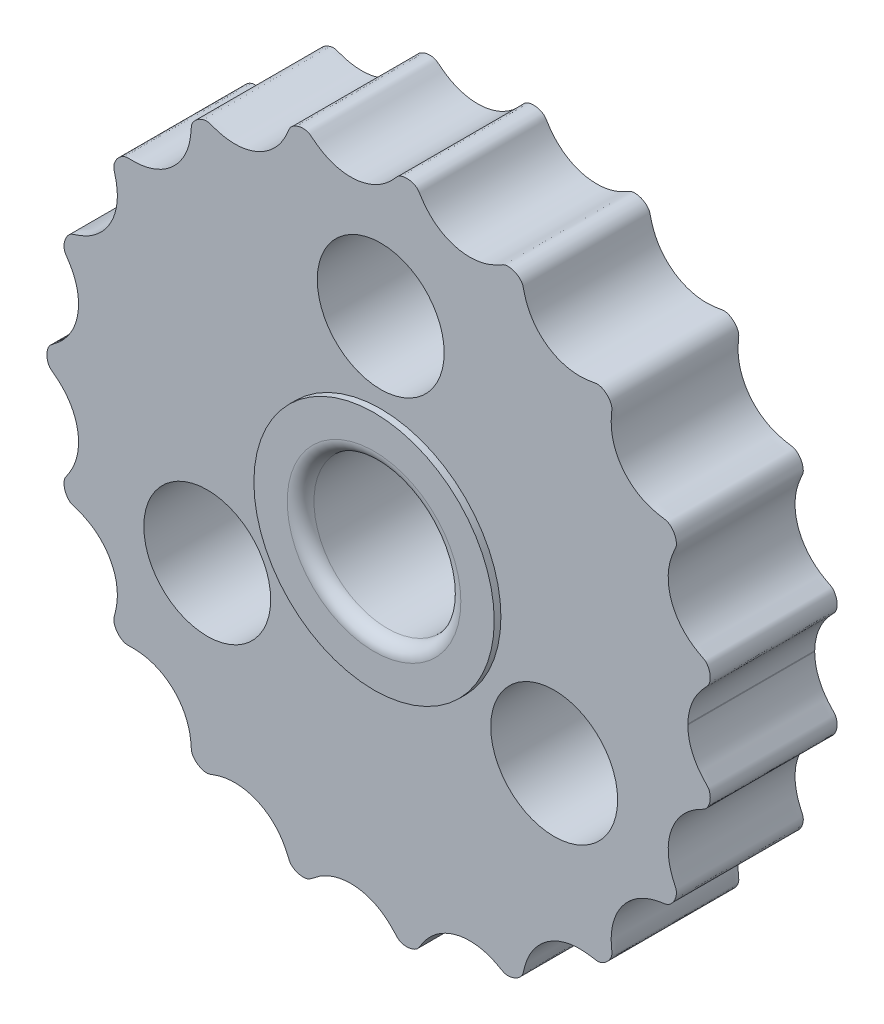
ISO-10303-21;
HEADER;
FILE_DESCRIPTION(('STEP AP214'),'2;1');
FILE_NAME('part.step','',(''),(''),'','','');
FILE_SCHEMA(('AUTOMOTIVE_DESIGN { 1 0 10303 214 1 1 1 1 }'));
ENDSEC;
DATA;
#1=APPLICATION_CONTEXT('core data for automotive mechanical design processes');
#2=APPLICATION_PROTOCOL_DEFINITION('international standard','automotive_design',2000,#1);
#3=PRODUCT_CONTEXT('',#1,'mechanical');
#4=PRODUCT('Part','Part','',(#3));
#5=PRODUCT_RELATED_PRODUCT_CATEGORY('part','',(#4));
#6=PRODUCT_DEFINITION_FORMATION('','',#4);
#7=PRODUCT_DEFINITION_CONTEXT('part definition',#1,'design');
#8=PRODUCT_DEFINITION('design','',#6,#7);
#9=PRODUCT_DEFINITION_SHAPE('','',#8);
#10=(LENGTH_UNIT() NAMED_UNIT(*) SI_UNIT(.MILLI.,.METRE.));
#11=(NAMED_UNIT(*) PLANE_ANGLE_UNIT() SI_UNIT($,.RADIAN.));
#12=(NAMED_UNIT(*) SI_UNIT($,.STERADIAN.) SOLID_ANGLE_UNIT());
#13=UNCERTAINTY_MEASURE_WITH_UNIT(LENGTH_MEASURE(1.E-05),#10,'distance_accuracy_value','');
#14=(GEOMETRIC_REPRESENTATION_CONTEXT(3) GLOBAL_UNCERTAINTY_ASSIGNED_CONTEXT((#13)) GLOBAL_UNIT_ASSIGNED_CONTEXT((#10,
#11,#12)) REPRESENTATION_CONTEXT('',''));
#15=CARTESIAN_POINT('',(0.,0.,0.));
#16=DIRECTION('',(0.,0.,1.));
#17=DIRECTION('',(1.,0.,0.));
#18=AXIS2_PLACEMENT_3D('',#15,#16,#17);
#19=CARTESIAN_POINT('',(0.,0.,0.));
#20=DIRECTION('',(0.,0.,1.));
#21=DIRECTION('',(1.,0.,0.));
#22=AXIS2_PLACEMENT_3D('',#19,#20,#21);
#23=PLANE('',#22);
#24=CARTESIAN_POINT('',(0.,15.,0.));
#25=DIRECTION('',(0.,0.,-1.));
#26=DIRECTION('',(-1.,0.,0.));
#27=AXIS2_PLACEMENT_3D('',#24,#25,#26);
#28=CIRCLE('',#27,4.75);
#29=CARTESIAN_POINT('',(-4.75,15.,0.));
#30=VERTEX_POINT('',#29);
#31=EDGE_CURVE('E154',#30,#30,#28,.T.);
#32=ORIENTED_EDGE('',*,*,#31,.F.);
#33=EDGE_LOOP('',(#32));
#34=FACE_BOUND('',#33,.T.);
#35=CARTESIAN_POINT('',(-12.9903810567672,-7.49999999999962,0.));
#36=DIRECTION('',(0.,0.,-1.));
#37=DIRECTION('',(-1.,0.,0.));
#38=AXIS2_PLACEMENT_3D('',#35,#36,#37);
#39=CIRCLE('',#38,4.75);
#40=CARTESIAN_POINT('',(-17.7403810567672,-7.49999999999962,0.));
#41=VERTEX_POINT('',#40);
#42=EDGE_CURVE('E172',#41,#41,#39,.T.);
#43=ORIENTED_EDGE('',*,*,#42,.F.);
#44=EDGE_LOOP('',(#43));
#45=FACE_BOUND('',#44,.T.);
#46=CARTESIAN_POINT('',(12.9903810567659,-7.50000000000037,0.));
#47=DIRECTION('',(0.,0.,-1.));
#48=DIRECTION('',(-1.,0.,0.));
#49=AXIS2_PLACEMENT_3D('',#46,#47,#48);
#50=CIRCLE('',#49,4.75);
#51=CARTESIAN_POINT('',(8.24038105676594,-7.50000000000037,0.));
#52=VERTEX_POINT('',#51);
#53=EDGE_CURVE('E168',#52,#52,#50,.T.);
#54=ORIENTED_EDGE('',*,*,#53,.F.);
#55=EDGE_LOOP('',(#54));
#56=FACE_BOUND('',#55,.T.);
#57=CARTESIAN_POINT('',(0.,0.,0.));
#58=DIRECTION('',(0.,0.,1.));
#59=DIRECTION('',(1.,0.,0.));
#60=AXIS2_PLACEMENT_3D('',#57,#58,#59);
#61=CIRCLE('',#60,6.5);
#62=CARTESIAN_POINT('',(6.5,0.,0.));
#63=VERTEX_POINT('',#62);
#64=EDGE_CURVE('E53',#63,#63,#61,.T.);
#65=ORIENTED_EDGE('',*,*,#64,.T.);
#66=EDGE_LOOP('',(#65));
#67=FACE_BOUND('',#66,.T.);
#68=CARTESIAN_POINT('',(23.0004450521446,0.0609374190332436,0.));
#69=CARTESIAN_POINT('',(23.0010644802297,0.103341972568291,0.));
#70=CARTESIAN_POINT('',(23.0038092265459,0.188906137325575,0.));
#71=CARTESIAN_POINT('',(23.0131501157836,0.367843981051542,0.));
#72=CARTESIAN_POINT('',(23.0334981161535,0.534909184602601,0.));
#73=CARTESIAN_POINT('',(23.0705654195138,0.786083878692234,0.));
#74=CARTESIAN_POINT('',(23.1320141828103,1.06083292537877,0.));
#75=CARTESIAN_POINT('',(23.2545603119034,1.4742128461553,0.));
#76=CARTESIAN_POINT('',(23.4419605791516,1.90190498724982,0.));
#77=CARTESIAN_POINT('',(23.6526500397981,2.26726702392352,0.));
#78=CARTESIAN_POINT('',(23.8668861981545,2.5657364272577,0.));
#79=CARTESIAN_POINT('',(24.0252943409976,2.76594758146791,0.));
#80=CARTESIAN_POINT('',(24.1558379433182,2.91651817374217,0.));
#81=CARTESIAN_POINT('',(24.2851186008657,3.05651856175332,0.));
#82=CARTESIAN_POINT('',(24.4048398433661,3.18265204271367,0.));
#83=CARTESIAN_POINT('',(24.4955538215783,3.27862792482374,0.));
#84=CARTESIAN_POINT('',(24.5776413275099,3.3978753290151,0.));
#85=CARTESIAN_POINT('',(24.6403019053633,3.55800179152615,0.));
#86=CARTESIAN_POINT('',(24.6804298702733,3.75861614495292,0.));
#87=CARTESIAN_POINT('',(24.6829995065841,3.99723654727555,0.));
#88=CARTESIAN_POINT('',(24.6407164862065,4.24466441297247,0.));
#89=CARTESIAN_POINT('',(24.5598566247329,4.46599330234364,0.));
#90=CARTESIAN_POINT('',(24.4632988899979,4.62969794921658,0.));
#91=CARTESIAN_POINT('',(24.3700046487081,4.74154404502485,0.));
#92=CARTESIAN_POINT('',(24.2934573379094,4.80789336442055,0.));
#93=CARTESIAN_POINT('',(24.2331727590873,4.84919927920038,0.));
#94=CARTESIAN_POINT('',(24.1436718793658,4.90049686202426,0.));
#95=CARTESIAN_POINT('',(24.0251482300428,4.96086436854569,0.));
#96=CARTESIAN_POINT('',(23.8813705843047,5.03731738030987,0.));
#97=CARTESIAN_POINT('',(23.712869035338,5.13135954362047,0.));
#98=CARTESIAN_POINT('',(23.5008423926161,5.25969202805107,0.));
#99=CARTESIAN_POINT('',(23.2503084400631,5.42998618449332,0.));
#100=CARTESIAN_POINT('',(22.9679235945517,5.6540978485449,0.));
#101=CARTESIAN_POINT('',(22.6665695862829,5.94375033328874,0.));
#102=CARTESIAN_POINT('',(22.3909280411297,6.26615978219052,0.));
#103=CARTESIAN_POINT('',(22.1456648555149,6.6198575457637,0.));
#104=CARTESIAN_POINT('',(21.8865384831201,7.09053710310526,0.));
#105=CARTESIAN_POINT('',(21.6972444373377,7.58461786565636,0.));
#106=CARTESIAN_POINT('',(21.5786507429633,8.08655156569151,0.));
#107=CARTESIAN_POINT('',(21.5272191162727,8.58267339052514,0.));
#108=CARTESIAN_POINT('',(21.5223920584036,8.96260511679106,0.));
#109=CARTESIAN_POINT('',(21.5508966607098,9.33550554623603,0.));
#110=CARTESIAN_POINT('',(21.6103337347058,9.69862880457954,0.));
#111=CARTESIAN_POINT('',(21.6878411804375,10.0086036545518,0.));
#112=CARTESIAN_POINT('',(21.7706113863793,10.2666438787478,0.));
#113=CARTESIAN_POINT('',(21.8498829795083,10.4781783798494,0.));
#114=CARTESIAN_POINT('',(21.919038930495,10.6454192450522,0.));
#115=CARTESIAN_POINT('',(21.9816260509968,10.7867118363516,0.));
#116=CARTESIAN_POINT('',(22.035042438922,10.9030063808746,0.));
#117=CARTESIAN_POINT('',(22.084453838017,11.0131731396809,0.));
#118=CARTESIAN_POINT('',(22.1290439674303,11.1266774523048,0.));
#119=CARTESIAN_POINT('',(22.1489992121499,11.2598240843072,0.));
#120=CARTESIAN_POINT('',(22.1435566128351,11.4053666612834,0.));
#121=CARTESIAN_POINT('',(22.1170450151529,11.5725890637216,0.));
#122=CARTESIAN_POINT('',(22.0633944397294,11.7504492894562,0.));
#123=CARTESIAN_POINT('',(21.9702363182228,11.946885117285,0.));
#124=CARTESIAN_POINT('',(21.8436701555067,12.1238066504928,0.));
#125=CARTESIAN_POINT('',(21.7133767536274,12.2560985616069,0.));
#126=CARTESIAN_POINT('',(21.5962964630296,12.3450186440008,0.));
#127=CARTESIAN_POINT('',(21.5025310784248,12.4008340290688,0.));
#128=CARTESIAN_POINT('',(21.3990220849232,12.4432188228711,0.));
#129=CARTESIAN_POINT('',(21.2868217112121,12.4679022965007,0.));
#130=CARTESIAN_POINT('',(21.130878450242,12.4903115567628,0.));
#131=CARTESIAN_POINT('',(20.953603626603,12.5182372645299,0.));
#132=CARTESIAN_POINT('',(20.7643712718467,12.5521053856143,0.));
#133=CARTESIAN_POINT('',(20.5194912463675,12.605928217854,0.));
#134=CARTESIAN_POINT('',(20.1600221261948,12.7034344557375,0.));
#135=CARTESIAN_POINT('',(19.6713346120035,12.8869653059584,0.));
#136=CARTESIAN_POINT('',(19.0810609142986,13.213737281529,0.));
#137=CARTESIAN_POINT('',(18.4823551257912,13.7066338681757,0.));
#138=CARTESIAN_POINT('',(17.9827894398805,14.3046626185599,0.));
#139=CARTESIAN_POINT('',(17.6070636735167,14.9758213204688,0.));
#140=CARTESIAN_POINT('',(17.3914134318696,15.6061212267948,0.));
#141=CARTESIAN_POINT('',(17.2886005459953,16.1631502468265,0.));
#142=CARTESIAN_POINT('',(17.2593961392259,16.5774164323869,0.));
#143=CARTESIAN_POINT('',(17.2581121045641,16.8499339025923,0.));
#144=CARTESIAN_POINT('',(17.2672347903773,17.070006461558,0.));
#145=CARTESIAN_POINT('',(17.2791263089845,17.2377183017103,0.));
#146=CARTESIAN_POINT('',(17.2934381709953,17.3967835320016,0.));
#147=CARTESIAN_POINT('',(17.3092886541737,17.5470541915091,0.));
#148=CARTESIAN_POINT('',(17.3188500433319,17.7044671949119,0.));
#149=CARTESIAN_POINT('',(17.2904355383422,17.8485405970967,0.));
#150=CARTESIAN_POINT('',(17.2386992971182,17.9815332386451,0.));
#151=CARTESIAN_POINT('',(17.1576230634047,18.1323633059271,0.));
#152=CARTESIAN_POINT('',(17.0476886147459,18.2836398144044,0.));
#153=CARTESIAN_POINT('',(16.8932226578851,18.4399573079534,0.));
#154=CARTESIAN_POINT('',(16.712767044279,18.5662875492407,0.));
#155=CARTESIAN_POINT('',(16.5434032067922,18.6483748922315,0.));
#156=CARTESIAN_POINT('',(16.3919147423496,18.695708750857,0.));
#157=CARTESIAN_POINT('',(16.2633999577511,18.7185500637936,0.));
#158=CARTESIAN_POINT('',(16.1187982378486,18.7114090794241,0.));
#159=CARTESIAN_POINT('',(15.9628511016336,18.6804311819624,0.));
#160=CARTESIAN_POINT('',(15.7955730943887,18.6509993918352,0.));
#161=CARTESIAN_POINT('',(15.6162821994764,18.6220231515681,0.));
#162=CARTESIAN_POINT('',(15.431926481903,18.5982744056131,0.));
#163=CARTESIAN_POINT('',(15.2424369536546,18.5806300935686,0.));
#164=CARTESIAN_POINT('',(14.9983346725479,18.5678165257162,0.));
#165=CARTESIAN_POINT('',(14.6978223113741,18.5692961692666,0.));
#166=CARTESIAN_POINT('',(14.3465623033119,18.5976695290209,0.));
#167=CARTESIAN_POINT('',(13.8413545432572,18.6865447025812,0.));
#168=CARTESIAN_POINT('',(13.3474045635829,18.8414163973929,0.));
#169=CARTESIAN_POINT('',(12.8766615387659,19.0607681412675,0.));
#170=CARTESIAN_POINT('',(12.4404070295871,19.3396979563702,0.));
#171=CARTESIAN_POINT('',(12.1194362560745,19.5923890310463,0.));
#172=CARTESIAN_POINT('',(11.82732244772,19.8724017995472,0.));
#173=CARTESIAN_POINT('',(11.5657738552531,20.1760918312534,0.));
#174=CARTESIAN_POINT('',(11.2824305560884,20.5759636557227,0.));
#175=CARTESIAN_POINT('',(11.074042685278,20.961211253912,0.));
#176=CARTESIAN_POINT('',(10.9260104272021,21.3181212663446,0.));
#177=CARTESIAN_POINT('',(10.8223643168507,21.6364879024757,0.));
#178=CARTESIAN_POINT('',(10.7696450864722,21.8218639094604,0.));
#179=CARTESIAN_POINT('',(10.7283691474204,21.9832781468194,0.));
#180=CARTESIAN_POINT('',(10.6965388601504,22.1195677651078,0.));
#181=CARTESIAN_POINT('',(10.6698067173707,22.2304212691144,0.));
#182=CARTESIAN_POINT('',(10.6459464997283,22.3149341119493,0.));
#183=CARTESIAN_POINT('',(10.6031755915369,22.4212366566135,0.));
#184=CARTESIAN_POINT('',(10.5340769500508,22.5263972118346,0.));
#185=CARTESIAN_POINT('',(10.4440730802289,22.6278247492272,0.));
#186=CARTESIAN_POINT('',(10.3090535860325,22.7454665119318,0.));
#187=CARTESIAN_POINT('',(10.1449197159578,22.8528142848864,0.));
#188=CARTESIAN_POINT('',(9.96573029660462,22.9333716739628,0.));
#189=CARTESIAN_POINT('',(9.77675296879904,22.9846340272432,0.));
#190=CARTESIAN_POINT('',(9.59966398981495,23.008128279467,0.));
#191=CARTESIAN_POINT('',(9.4518387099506,23.0082709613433,0.));
#192=CARTESIAN_POINT('',(9.30082605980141,22.9868990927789,0.));
#193=CARTESIAN_POINT('',(9.14843663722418,22.9195820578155,0.));
#194=CARTESIAN_POINT('',(9.00629573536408,22.8364891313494,0.));
#195=CARTESIAN_POINT('',(8.85136035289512,22.7515834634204,0.));
#196=CARTESIAN_POINT('',(8.68415685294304,22.6633743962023,0.));
#197=CARTESIAN_POINT('',(8.4659469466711,22.557985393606,0.));
#198=CARTESIAN_POINT('',(8.1934656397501,22.442983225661,0.));
#199=CARTESIAN_POINT('',(7.8577537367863,22.3290184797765,0.));
#200=CARTESIAN_POINT('',(7.45596770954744,22.2330420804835,0.));
#201=CARTESIAN_POINT('',(7.03996906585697,22.1755239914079,0.));
#202=CARTESIAN_POINT('',(6.61357111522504,22.1597399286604,0.));
#203=CARTESIAN_POINT('',(6.1032438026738,22.1928478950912,0.));
#204=CARTESIAN_POINT('',(5.60993913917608,22.2896928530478,0.));
#205=CARTESIAN_POINT('',(5.14338857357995,22.4442843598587,0.));
#206=CARTESIAN_POINT('',(4.71453132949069,22.6471757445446,0.));
#207=CARTESIAN_POINT('',(4.39111897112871,22.8375133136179,0.));
#208=CARTESIAN_POINT('',(4.08670751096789,23.0547537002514,0.));
#209=CARTESIAN_POINT('',(3.80304315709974,23.2967196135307,0.));
#210=CARTESIAN_POINT('',(3.54117376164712,23.5622918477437,0.));
#211=CARTESIAN_POINT('',(3.33135134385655,23.8136303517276,0.));
#212=CARTESIAN_POINT('',(3.16729935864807,24.0378234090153,0.));
#213=CARTESIAN_POINT('',(3.05128465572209,24.2110609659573,0.));
#214=CARTESIAN_POINT('',(2.97407854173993,24.3312155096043,0.));
#215=CARTESIAN_POINT('',(2.90893122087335,24.4353210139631,0.));
#216=CARTESIAN_POINT('',(2.8530196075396,24.5220232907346,0.));
#217=CARTESIAN_POINT('',(2.77763239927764,24.6216491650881,0.));
#218=CARTESIAN_POINT('',(2.67867992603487,24.7064419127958,0.));
#219=CARTESIAN_POINT('',(2.56349711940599,24.7759495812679,0.));
#220=CARTESIAN_POINT('',(2.4075865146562,24.8456503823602,0.));
#221=CARTESIAN_POINT('',(2.2283539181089,24.8981764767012,0.));
#222=CARTESIAN_POINT('',(2.01091815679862,24.9274566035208,0.));
#223=CARTESIAN_POINT('',(1.79118975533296,24.9173237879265,0.));
#224=CARTESIAN_POINT('',(1.6073060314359,24.8790281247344,0.));
#225=CARTESIAN_POINT('',(1.4665345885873,24.8274053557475,0.));
#226=CARTESIAN_POINT('',(1.36596425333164,24.7764513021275,0.));
#227=CARTESIAN_POINT('',(1.28490950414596,24.7171219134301,0.));
#228=CARTESIAN_POINT('',(1.22151119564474,24.6555969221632,0.));
#229=CARTESIAN_POINT('',(1.15343854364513,24.5815042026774,0.));
#230=CARTESIAN_POINT('',(1.07877477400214,24.4970564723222,0.));
#231=CARTESIAN_POINT('',(0.990419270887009,24.3996139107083,0.));
#232=CARTESIAN_POINT('',(0.879528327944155,24.2812996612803,0.));
#233=CARTESIAN_POINT('',(0.757233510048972,24.1576265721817,0.));
#234=CARTESIAN_POINT('',(0.586090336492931,23.9963966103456,0.));
#235=CARTESIAN_POINT('',(0.279913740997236,23.7377910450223,0.));
#236=CARTESIAN_POINT('',(-0.185417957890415,23.4210136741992,0.));
#237=CARTESIAN_POINT('',(-0.841139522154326,23.1135331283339,0.));
#238=CARTESIAN_POINT('',(-1.63279965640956,22.9187714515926,0.));
#239=CARTESIAN_POINT('',(-2.42970180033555,22.8811842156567,0.));
#240=CARTESIAN_POINT('',(-3.18969687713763,22.98750840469,0.));
#241=CARTESIAN_POINT('',(-3.80648197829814,23.1882776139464,0.));
#242=CARTESIAN_POINT('',(-4.25792544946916,23.40952083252,0.));
#243=CARTESIAN_POINT('',(-4.56567071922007,23.5972605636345,0.));
#244=CARTESIAN_POINT('',(-4.7458498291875,23.7196194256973,0.));
#245=CARTESIAN_POINT('',(-4.87956659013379,23.8169925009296,0.));
#246=CARTESIAN_POINT('',(-5.00520766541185,23.9132889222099,0.));
#247=CARTESIAN_POINT('',(-5.10839703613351,23.9954562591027,0.));
#248=CARTESIAN_POINT('',(-5.1962832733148,24.0667457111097,0.));
#249=CARTESIAN_POINT('',(-5.27555451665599,24.1275195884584,0.));
#250=CARTESIAN_POINT('',(-5.34752737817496,24.1751925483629,0.));
#251=CARTESIAN_POINT('',(-5.45544706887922,24.226628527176,0.));
#252=CARTESIAN_POINT('',(-5.61332665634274,24.2679019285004,0.));
#253=CARTESIAN_POINT('',(-5.81248805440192,24.2858139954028,0.));
#254=CARTESIAN_POINT('',(-6.04892210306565,24.2634708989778,0.));
#255=CARTESIAN_POINT('',(-6.28478849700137,24.1982333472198,0.));
#256=CARTESIAN_POINT('',(-6.4910822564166,24.0996183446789,0.));
#257=CARTESIAN_POINT('',(-6.6528295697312,23.9826572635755,0.));
#258=CARTESIAN_POINT('',(-6.7731717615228,23.8583116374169,0.));
#259=CARTESIAN_POINT('',(-6.83961553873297,23.7424509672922,0.));
#260=CARTESIAN_POINT('',(-6.88287024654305,23.6417345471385,0.));
#261=CARTESIAN_POINT('',(-6.92897548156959,23.5322327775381,0.));
#262=CARTESIAN_POINT('',(-6.97918741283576,23.4142809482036,0.));
#263=CARTESIAN_POINT('',(-7.04005614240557,23.2775073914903,0.));
#264=CARTESIAN_POINT('',(-7.11617893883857,23.1178274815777,0.));
#265=CARTESIAN_POINT('',(-7.20056760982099,22.9555859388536,0.));
#266=CARTESIAN_POINT('',(-7.3180100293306,22.7492499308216,0.));
#267=CARTESIAN_POINT('',(-7.47816968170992,22.5012513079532,0.));
#268=CARTESIAN_POINT('',(-7.68753153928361,22.2243018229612,0.));
#269=CARTESIAN_POINT('',(-7.95814510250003,21.9275718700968,0.));
#270=CARTESIAN_POINT('',(-8.2599123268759,21.6541948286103,0.));
#271=CARTESIAN_POINT('',(-8.66083173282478,21.3562771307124,0.));
#272=CARTESIAN_POINT('',(-9.18181951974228,21.0633248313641,0.));
#273=CARTESIAN_POINT('',(-9.73536554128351,20.8583848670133,0.));
#274=CARTESIAN_POINT('',(-10.3037773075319,20.7431634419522,0.));
#275=CARTESIAN_POINT('',(-10.7833094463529,20.705631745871,0.));
#276=CARTESIAN_POINT('',(-11.1616253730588,20.7096634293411,0.));
#277=CARTESIAN_POINT('',(-11.5388634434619,20.7468047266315,0.));
#278=CARTESIAN_POINT('',(-11.8655396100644,20.8075028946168,0.));
#279=CARTESIAN_POINT('',(-12.1413237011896,20.878074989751,0.));
#280=CARTESIAN_POINT('',(-12.3518739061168,20.943093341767,0.));
#281=CARTESIAN_POINT('',(-12.5000613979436,20.9929725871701,0.));
#282=CARTESIAN_POINT('',(-12.6314970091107,21.0397639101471,0.));
#283=CARTESIAN_POINT('',(-12.7469137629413,21.0816629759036,0.));
#284=CARTESIAN_POINT('',(-12.8816892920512,21.1275848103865,0.));
#285=CARTESIAN_POINT('',(-13.0232174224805,21.1443617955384,0.));
#286=CARTESIAN_POINT('',(-13.1646854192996,21.131095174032,0.));
#287=CARTESIAN_POINT('',(-13.3350151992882,21.0938854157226,0.));
#288=CARTESIAN_POINT('',(-13.5127331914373,21.0275671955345,0.));
#289=CARTESIAN_POINT('',(-13.70771107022,20.918241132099,0.));
#290=CARTESIAN_POINT('',(-13.8803938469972,20.7741716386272,0.));
#291=CARTESIAN_POINT('',(-14.0059492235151,20.6294351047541,0.));
#292=CARTESIAN_POINT('',(-14.0873372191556,20.5014982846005,0.));
#293=CARTESIAN_POINT('',(-14.1362001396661,20.400514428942,0.));
#294=CARTESIAN_POINT('',(-14.1696652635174,20.2905284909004,0.));
#295=CARTESIAN_POINT('',(-14.1839673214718,20.173300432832,0.));
#296=CARTESIAN_POINT('',(-14.1936306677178,20.0116167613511,0.));
#297=CARTESIAN_POINT('',(-14.207496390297,19.8274109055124,0.));
#298=CARTESIAN_POINT('',(-14.2268591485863,19.6305753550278,0.));
#299=CARTESIAN_POINT('',(-14.26271195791,19.375130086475,0.));
#300=CARTESIAN_POINT('',(-14.3350990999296,18.9985849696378,0.));
#301=CARTESIAN_POINT('',(-14.4878193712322,18.4826931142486,0.));
#302=CARTESIAN_POINT('',(-14.7830279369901,17.8542035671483,0.));
#303=CARTESIAN_POINT('',(-15.2484658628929,17.213007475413,0.));
#304=CARTESIAN_POINT('',(-15.823885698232,16.6734473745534,0.));
#305=CARTESIAN_POINT('',(-16.3973526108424,16.3085128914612,0.));
#306=CARTESIAN_POINT('',(-16.9177749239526,16.0786260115,0.));
#307=CARTESIAN_POINT('',(-17.3647339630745,15.9410111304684,0.));
#308=CARTESIAN_POINT('',(-17.7248018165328,15.8628091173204,0.));
#309=CARTESIAN_POINT('',(-18.0412846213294,15.820863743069,0.));
#310=CARTESIAN_POINT('',(-18.3106294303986,15.802325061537,0.));
#311=CARTESIAN_POINT('',(-18.5320417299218,15.7969443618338,0.));
#312=CARTESIAN_POINT('',(-18.6836276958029,15.7969225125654,0.));
#313=CARTESIAN_POINT('',(-18.8132574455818,15.7990809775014,0.));
#314=CARTESIAN_POINT('',(-18.9269805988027,15.8005385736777,0.));
#315=CARTESIAN_POINT('',(-19.0245949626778,15.7984869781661,0.));
#316=CARTESIAN_POINT('',(-19.1503625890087,15.7793808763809,0.));
#317=CARTESIAN_POINT('',(-19.2786587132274,15.7292741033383,0.));
#318=CARTESIAN_POINT('',(-19.4017458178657,15.6607359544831,0.));
#319=CARTESIAN_POINT('',(-19.5437475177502,15.5557400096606,0.));
#320=CARTESIAN_POINT('',(-19.6794119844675,15.4254489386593,0.));
#321=CARTESIAN_POINT('',(-19.8125272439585,15.252166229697,0.));
#322=CARTESIAN_POINT('',(-19.9195409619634,15.0445062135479,0.));
#323=CARTESIAN_POINT('',(-19.9741862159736,14.8643202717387,0.));
#324=CARTESIAN_POINT('',(-19.993465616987,14.721716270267,0.));
#325=CARTESIAN_POINT('',(-19.9911465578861,14.6219173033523,0.));
#326=CARTESIAN_POINT('',(-19.9814906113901,14.5508659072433,0.));
#327=CARTESIAN_POINT('',(-19.9596359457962,14.4520422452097,0.));
#328=CARTESIAN_POINT('',(-19.9244302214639,14.3263366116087,0.));
#329=CARTESIAN_POINT('',(-19.8839286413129,14.1718166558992,0.));
#330=CARTESIAN_POINT('',(-19.83941825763,13.9878017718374,0.));
#331=CARTESIAN_POINT('',(-19.7902400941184,13.7494276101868,0.));
#332=CARTESIAN_POINT('',(-19.7451420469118,13.4551748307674,0.));
#333=CARTESIAN_POINT('',(-19.7169078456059,13.1023532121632,0.));
#334=CARTESIAN_POINT('',(-19.722218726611,12.6922723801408,0.));
#335=CARTESIAN_POINT('',(-19.7673351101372,12.2788625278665,0.));
#336=CARTESIAN_POINT('',(-19.85423085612,11.8662508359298,0.));
#337=CARTESIAN_POINT('',(-20.0143814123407,11.3636435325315,0.));
#338=CARTESIAN_POINT('',(-20.2770751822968,10.8105198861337,0.));
#339=CARTESIAN_POINT('',(-20.6164390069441,10.3191130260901,0.));
#340=CARTESIAN_POINT('',(-21.0150684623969,9.899172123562,0.));
#341=CARTESIAN_POINT('',(-21.3660194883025,9.60628322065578,0.));
#342=CARTESIAN_POINT('',(-21.6595973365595,9.40050749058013,0.));
#343=CARTESIAN_POINT('',(-21.9661729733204,9.22095812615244,0.));
#344=CARTESIAN_POINT('',(-22.2434766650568,9.08647526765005,0.));
#345=CARTESIAN_POINT('',(-22.487141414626,8.985853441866,0.));
#346=CARTESIAN_POINT('',(-22.6971275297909,8.90966358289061,0.));
#347=CARTESIAN_POINT('',(-22.8484016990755,8.85832288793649,0.));
#348=CARTESIAN_POINT('',(-22.9816290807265,8.81586827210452,0.));
#349=CARTESIAN_POINT('',(-23.0968211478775,8.7757949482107,0.));
#350=CARTESIAN_POINT('',(-23.1870132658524,8.73389595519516,0.));
#351=CARTESIAN_POINT('',(-23.2911900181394,8.66248407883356,0.));
#352=CARTESIAN_POINT('',(-23.4082170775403,8.54904085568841,0.));
#353=CARTESIAN_POINT('',(-23.5263335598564,8.39080511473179,0.));
#354=CARTESIAN_POINT('',(-23.6303183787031,8.18310432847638,0.));
#355=CARTESIAN_POINT('',(-23.6995028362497,7.95346432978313,0.));
#356=CARTESIAN_POINT('',(-23.726069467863,7.73085575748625,0.));
#357=CARTESIAN_POINT('',(-23.7141681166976,7.53088332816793,0.));
#358=CARTESIAN_POINT('',(-23.6712468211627,7.35676687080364,0.));
#359=CARTESIAN_POINT('',(-23.587535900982,7.2107568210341,0.));
#360=CARTESIAN_POINT('',(-23.4888308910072,7.07016675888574,0.));
#361=CARTESIAN_POINT('',(-23.3882676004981,6.91694785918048,0.));
#362=CARTESIAN_POINT('',(-23.2843627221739,6.75241089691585,0.));
#363=CARTESIAN_POINT('',(-23.1587096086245,6.53560145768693,0.));
#364=CARTESIAN_POINT('',(-23.0192784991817,6.26245241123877,0.));
#365=CARTESIAN_POINT('',(-22.877747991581,5.92438993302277,0.));
#366=CARTESIAN_POINT('',(-22.7518654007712,5.51735194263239,0.));
#367=CARTESIAN_POINT('',(-22.6663634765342,5.09510154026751,0.));
#368=CARTESIAN_POINT('',(-22.624177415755,4.66168506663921,0.));
#369=CARTESIAN_POINT('',(-22.6277437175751,4.14416476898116,0.));
#370=CARTESIAN_POINT('',(-22.6969215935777,3.64321925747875,0.));
#371=CARTESIAN_POINT('',(-22.8250601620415,3.16849461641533,0.));
#372=CARTESIAN_POINT('',(-23.0025794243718,2.73028397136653,0.));
#373=CARTESIAN_POINT('',(-23.1734074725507,2.39759943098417,0.));
#374=CARTESIAN_POINT('',(-23.3714935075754,2.08291514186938,0.));
#375=CARTESIAN_POINT('',(-23.5945603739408,1.7879594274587,0.));
#376=CARTESIAN_POINT('',(-23.8110817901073,1.54694379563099,0.));
#377=CARTESIAN_POINT('',(-24.0104853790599,1.35312204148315,0.));
#378=CARTESIAN_POINT('',(-24.1832927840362,1.20112568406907,0.));
#379=CARTESIAN_POINT('',(-24.3242369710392,1.08551778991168,0.));
#380=CARTESIAN_POINT('',(-24.4487192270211,0.988664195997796,0.));
#381=CARTESIAN_POINT('',(-24.5548708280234,0.908952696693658,0.));
#382=CARTESIAN_POINT('',(-24.6411994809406,0.843342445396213,0.));
#383=CARTESIAN_POINT('',(-24.7061246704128,0.790339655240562,0.));
#384=CARTESIAN_POINT('',(-24.7831824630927,0.713841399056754,0.));
#385=CARTESIAN_POINT('',(-24.8504413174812,0.61561561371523,0.));
#386=CARTESIAN_POINT('',(-24.9066420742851,0.50012631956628,0.));
#387=CARTESIAN_POINT('',(-24.9616031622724,0.3399066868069,0.));
#388=CARTESIAN_POINT('',(-24.9980291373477,0.156872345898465,0.));
#389=CARTESIAN_POINT('',(-25.0079752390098,-0.0615272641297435,0.));
#390=CARTESIAN_POINT('',(-24.9788835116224,-0.278375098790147,0.));
#391=CARTESIAN_POINT('',(-24.9250325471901,-0.457300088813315,0.));
#392=CARTESIAN_POINT('',(-24.8613331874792,-0.593231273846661,0.));
#393=CARTESIAN_POINT('',(-24.8008989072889,-0.690159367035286,0.));
#394=CARTESIAN_POINT('',(-24.7323333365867,-0.767244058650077,0.));
#395=CARTESIAN_POINT('',(-24.6619915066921,-0.827034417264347,0.));
#396=CARTESIAN_POINT('',(-24.5779706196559,-0.891541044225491,0.));
#397=CARTESIAN_POINT('',(-24.482308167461,-0.963016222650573,0.));
#398=CARTESIAN_POINT('',(-24.3719847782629,-1.04823760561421,0.));
#399=CARTESIAN_POINT('',(-24.2390268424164,-1.15462412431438,0.));
#400=CARTESIAN_POINT('',(-24.1011027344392,-1.27221831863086,0.));
#401=CARTESIAN_POINT('',(-23.9221175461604,-1.43660713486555,0.));
#402=CARTESIAN_POINT('',(-23.6362767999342,-1.73077995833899,0.));
#403=CARTESIAN_POINT('',(-23.281762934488,-2.1835918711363,0.));
#404=CARTESIAN_POINT('',(-22.9271870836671,-2.83084957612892,0.));
#405=CARTESIAN_POINT('',(-22.6825732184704,-3.62085086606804,0.));
#406=CARTESIAN_POINT('',(-22.599242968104,-4.42206812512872,0.));
#407=CARTESIAN_POINT('',(-22.6560153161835,-5.10075585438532,0.));
#408=CARTESIAN_POINT('',(-22.7839328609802,-5.64508269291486,0.));
#409=CARTESIAN_POINT('',(-22.9383125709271,-6.07567291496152,0.));
#410=CARTESIAN_POINT('',(-23.0687206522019,-6.36331346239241,0.));
#411=CARTESIAN_POINT('',(-23.1954045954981,-6.60097575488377,0.));
#412=CARTESIAN_POINT('',(-23.3169904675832,-6.80553099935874,0.));
#413=CARTESIAN_POINT('',(-23.4134801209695,-6.95589523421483,0.));
#414=CARTESIAN_POINT('',(-23.5046446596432,-7.09189883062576,0.));
#415=CARTESIAN_POINT('',(-23.5869866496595,-7.21312038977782,0.));
#416=CARTESIAN_POINT('',(-23.6458842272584,-7.31129955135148,0.));
#417=CARTESIAN_POINT('',(-23.6936359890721,-7.43717701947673,0.));
#418=CARTESIAN_POINT('',(-23.7216283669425,-7.60152763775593,0.));
#419=CARTESIAN_POINT('',(-23.7223084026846,-7.80201130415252,0.));
#420=CARTESIAN_POINT('',(-23.6806344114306,-8.03349246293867,0.));
#421=CARTESIAN_POINT('',(-23.59593129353,-8.26306779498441,0.));
#422=CARTESIAN_POINT('',(-23.4800063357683,-8.46101706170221,0.));
#423=CARTESIAN_POINT('',(-23.3487704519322,-8.61326074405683,0.));
#424=CARTESIAN_POINT('',(-23.2127158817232,-8.7238612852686,0.));
#425=CARTESIAN_POINT('',(-23.0663566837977,-8.78968521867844,0.));
#426=CARTESIAN_POINT('',(-22.9125310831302,-8.83693719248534,0.));
#427=CARTESIAN_POINT('',(-22.748877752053,-8.89193738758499,0.));
#428=CARTESIAN_POINT('',(-22.5744954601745,-8.95337392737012,0.));
#429=CARTESIAN_POINT('',(-22.3540791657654,-9.03952140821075,0.));
#430=CARTESIAN_POINT('',(-22.0907560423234,-9.15759161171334,0.));
#431=CARTESIAN_POINT('',(-21.7859013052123,-9.3207230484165,0.));
#432=CARTESIAN_POINT('',(-21.4493417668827,-9.54194913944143,0.));
#433=CARTESIAN_POINT('',(-21.1295614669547,-9.79839843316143,0.));
#434=CARTESIAN_POINT('',(-20.8313398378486,-10.0897970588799,0.));
#435=CARTESIAN_POINT('',(-20.5060815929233,-10.4778880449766,0.));
#436=CARTESIAN_POINT('',(-20.2354524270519,-10.9007400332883,0.));
#437=CARTESIAN_POINT('',(-20.0234952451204,-11.3478403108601,0.));
#438=CARTESIAN_POINT('',(-19.8724944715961,-11.8050881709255,0.));
#439=CARTESIAN_POINT('',(-19.786480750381,-12.1771034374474,0.));
#440=CARTESIAN_POINT('',(-19.7342884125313,-12.5535769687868,0.));
#441=CARTESIAN_POINT('',(-19.7154994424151,-12.9315657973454,0.));
#442=CARTESIAN_POINT('',(-19.7297872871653,-13.3095414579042,0.));
#443=CARTESIAN_POINT('',(-19.7703384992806,-13.6387799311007,0.));
#444=CARTESIAN_POINT('',(-19.822738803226,-13.9153600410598,0.));
#445=CARTESIAN_POINT('',(-19.8775380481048,-14.1470425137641,0.));
#446=CARTESIAN_POINT('',(-19.9208953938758,-14.3131728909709,0.));
#447=CARTESIAN_POINT('',(-19.9621623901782,-14.4593821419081,0.));
#448=CARTESIAN_POINT('',(-19.9940619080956,-14.6091198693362,0.));
#449=CARTESIAN_POINT('',(-19.9941902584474,-14.7408999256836,0.));
#450=CARTESIAN_POINT('',(-19.9694030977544,-14.8748164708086,0.));
#451=CARTESIAN_POINT('',(-19.9174563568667,-15.0391698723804,0.));
#452=CARTESIAN_POINT('',(-19.8355386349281,-15.2103657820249,0.));
#453=CARTESIAN_POINT('',(-19.7097922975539,-15.394155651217,0.));
#454=CARTESIAN_POINT('',(-19.5524111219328,-15.5524234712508,0.));
#455=CARTESIAN_POINT('',(-19.3980896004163,-15.66434186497,0.));
#456=CARTESIAN_POINT('',(-19.2638687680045,-15.7341888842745,0.));
#457=CARTESIAN_POINT('',(-19.1585412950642,-15.7741625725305,0.));
#458=CARTESIAN_POINT('',(-19.0429650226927,-15.7980324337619,0.));
#459=CARTESIAN_POINT('',(-18.9192143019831,-15.8013130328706,0.));
#460=CARTESIAN_POINT('',(-18.7472333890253,-15.7970987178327,0.));
#461=CARTESIAN_POINT('',(-18.5515487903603,-15.7964119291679,0.));
#462=CARTESIAN_POINT('',(-18.3443653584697,-15.8008032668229,0.));
#463=CARTESIAN_POINT('',(-18.0778543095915,-15.8186981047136,0.));
#464=CARTESIAN_POINT('',(-17.6884272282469,-15.865276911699,0.));
#465=CARTESIAN_POINT('',(-17.1511717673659,-15.9855809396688,0.));
#466=CARTESIAN_POINT('',(-16.491481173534,-16.2456853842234,0.));
#467=CARTESIAN_POINT('',(-15.8123440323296,-16.6796683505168,0.));
#468=CARTESIAN_POINT('',(-15.2347483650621,-17.2299118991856,0.));
#469=CARTESIAN_POINT('',(-14.7820895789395,-17.8614300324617,0.));
#470=CARTESIAN_POINT('',(-14.4987938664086,-18.4602384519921,0.));
#471=CARTESIAN_POINT('',(-14.3484234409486,-18.9506966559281,0.));
#472=CARTESIAN_POINT('',(-14.2744379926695,-19.3095687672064,0.));
#473=CARTESIAN_POINT('',(-14.2356753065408,-19.5599770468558,0.));
#474=CARTESIAN_POINT('',(-14.2135300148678,-19.7574429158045,0.));
#475=CARTESIAN_POINT('',(-14.1984406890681,-19.9464050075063,0.));
#476=CARTESIAN_POINT('',(-14.1869135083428,-20.1194013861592,0.));
#477=CARTESIAN_POINT('',(-14.1772264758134,-20.2506342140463,0.));
#478=CARTESIAN_POINT('',(-14.1432637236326,-20.3907384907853,0.));
#479=CARTESIAN_POINT('',(-14.0670190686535,-20.5439346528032,0.));
#480=CARTESIAN_POINT('',(-13.9463238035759,-20.7079390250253,0.));
#481=CARTESIAN_POINT('',(-13.7726838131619,-20.8699590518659,0.));
#482=CARTESIAN_POINT('',(-13.5626064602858,-21.0051884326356,0.));
#483=CARTESIAN_POINT('',(-13.3458445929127,-21.0946672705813,0.));
#484=CARTESIAN_POINT('',(-13.1606618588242,-21.1340559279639,0.));
#485=CARTESIAN_POINT('',(-13.0154934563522,-21.1409328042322,0.));
#486=CARTESIAN_POINT('',(-12.9147776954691,-21.1293423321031,0.));
#487=CARTESIAN_POINT('',(-12.8431971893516,-21.1126992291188,0.));
#488=CARTESIAN_POINT('',(-12.7443393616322,-21.0812522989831,0.));
#489=CARTESIAN_POINT('',(-12.618960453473,-21.0346928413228,0.));
#490=CARTESIAN_POINT('',(-12.4644514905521,-20.9804324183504,0.));
#491=CARTESIAN_POINT('',(-12.2800722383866,-20.9199483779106,0.));
#492=CARTESIAN_POINT('',(-12.0407156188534,-20.8507689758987,0.));
#493=CARTESIAN_POINT('',(-11.7441360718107,-20.7818718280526,0.));
#494=CARTESIAN_POINT('',(-11.3859714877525,-20.7263071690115,0.));
#495=CARTESIAN_POINT('',(-10.9663821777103,-20.7016950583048,0.));
#496=CARTESIAN_POINT('',(-10.5400901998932,-20.718700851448,0.));
#497=CARTESIAN_POINT('',(-10.0057507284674,-20.7948541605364,0.));
#498=CARTESIAN_POINT('',(-9.48522843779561,-20.9439687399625,0.));
#499=CARTESIAN_POINT('',(-8.9999733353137,-21.1593640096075,0.));
#500=CARTESIAN_POINT('',(-8.56103981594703,-21.4293105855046,0.));
#501=CARTESIAN_POINT('',(-8.24840665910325,-21.665143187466,0.));
#502=CARTESIAN_POINT('',(-7.96834487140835,-21.9190171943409,0.));
#503=CARTESIAN_POINT('',(-7.71592832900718,-22.1921854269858,0.));
#504=CARTESIAN_POINT('',(-7.49148796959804,-22.4810340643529,0.));
#505=CARTESIAN_POINT('',(-7.31777393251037,-22.7471219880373,0.));
#506=CARTESIAN_POINT('',(-7.18529345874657,-22.9819952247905,0.));
#507=CARTESIAN_POINT('',(-7.0842516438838,-23.1830190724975,0.));
#508=CARTESIAN_POINT('',(-7.00856178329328,-23.3468667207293,0.));
#509=CARTESIAN_POINT('',(-6.94736540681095,-23.4881641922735,0.));
#510=CARTESIAN_POINT('',(-6.89842040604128,-23.6057776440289,0.));
#511=CARTESIAN_POINT('',(-6.85077043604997,-23.7158356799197,0.));
#512=CARTESIAN_POINT('',(-6.79658298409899,-23.8241479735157,0.));
#513=CARTESIAN_POINT('',(-6.71118125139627,-23.9271512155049,0.));
#514=CARTESIAN_POINT('',(-6.6006094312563,-24.0204484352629,0.));
#515=CARTESIAN_POINT('',(-6.45971156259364,-24.1129130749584,0.));
#516=CARTESIAN_POINT('',(-6.29313141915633,-24.1927464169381,0.));
#517=CARTESIAN_POINT('',(-6.08637470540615,-24.2561989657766,0.));
#518=CARTESIAN_POINT('',(-5.87153847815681,-24.2822335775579,0.));
#519=CARTESIAN_POINT('',(-5.68693790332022,-24.2756373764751,0.));
#520=CARTESIAN_POINT('',(-5.5427537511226,-24.2496031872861,0.));
#521=CARTESIAN_POINT('',(-5.43826830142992,-24.2182745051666,0.));
#522=CARTESIAN_POINT('',(-5.33678403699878,-24.1704369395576,0.));
#523=CARTESIAN_POINT('',(-5.24222400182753,-24.1039090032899,0.));
#524=CARTESIAN_POINT('',(-5.1193477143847,-24.0036919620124,0.));
#525=CARTESIAN_POINT('',(-4.97774686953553,-23.8914820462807,0.));
#526=CARTESIAN_POINT('',(-4.8235593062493,-23.7745521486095,0.));
#527=CARTESIAN_POINT('',(-4.61656485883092,-23.6301676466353,0.));
#528=CARTESIAN_POINT('',(-4.29889720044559,-23.4309620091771,0.));
#529=CARTESIAN_POINT('',(-3.82902320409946,-23.1952819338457,0.));
#530=CARTESIAN_POINT('',(-3.18377275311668,-22.9832848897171,0.));
#531=CARTESIAN_POINT('',(-2.41193691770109,-22.8800329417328,0.));
#532=CARTESIAN_POINT('',(-1.63302094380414,-22.921923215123,0.));
#533=CARTESIAN_POINT('',(-0.887269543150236,-23.1037030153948,0.));
#534=CARTESIAN_POINT('',(-0.281567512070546,-23.3733905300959,0.));
#535=CARTESIAN_POINT('',(0.194350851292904,-23.6752129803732,0.));
#536=CARTESIAN_POINT('',(0.516618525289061,-23.9340260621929,0.));
#537=CARTESIAN_POINT('',(0.71665654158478,-24.1173384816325,0.));
#538=CARTESIAN_POINT('',(0.871449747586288,-24.272798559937,0.));
#539=CARTESIAN_POINT('',(0.986207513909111,-24.3949086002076,0.));
#540=CARTESIAN_POINT('',(1.0929201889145,-24.5126035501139,0.));
#541=CARTESIAN_POINT('',(1.19190515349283,-24.625420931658,0.));
#542=CARTESIAN_POINT('',(1.30175329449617,-24.7374351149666,0.));
#543=CARTESIAN_POINT('',(1.42719632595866,-24.8122529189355,0.));
#544=CARTESIAN_POINT('',(1.55973942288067,-24.8633726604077,0.));
#545=CARTESIAN_POINT('',(1.72543451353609,-24.9048794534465,0.));
#546=CARTESIAN_POINT('',(1.91039113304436,-24.9256576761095,0.));
#547=CARTESIAN_POINT('',(2.12896751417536,-24.9172121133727,0.));
#548=CARTESIAN_POINT('',(2.34307020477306,-24.8697627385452,0.));
#549=CARTESIAN_POINT('',(2.51716990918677,-24.8007028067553,0.));
#550=CARTESIAN_POINT('',(2.65427971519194,-24.7214006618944,0.));
#551=CARTESIAN_POINT('',(2.74416188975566,-24.6523005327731,0.));
#552=CARTESIAN_POINT('',(2.8107409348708,-24.5787971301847,0.));
#553=CARTESIAN_POINT('',(2.87712116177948,-24.4860368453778,0.));
#554=CARTESIAN_POINT('',(2.94337025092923,-24.3793613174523,0.));
#555=CARTESIAN_POINT('',(3.02603718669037,-24.2496052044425,0.));
#556=CARTESIAN_POINT('',(3.12701413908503,-24.0973984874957,0.));
#557=CARTESIAN_POINT('',(3.26398205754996,-23.904047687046,0.));
#558=CARTESIAN_POINT('',(3.4440513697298,-23.674800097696,0.));
#559=CARTESIAN_POINT('',(3.67772189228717,-23.4168202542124,0.));
#560=CARTESIAN_POINT('',(3.97550664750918,-23.1429338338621,0.));
#561=CARTESIAN_POINT('',(4.30226720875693,-22.8948310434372,0.));
#562=CARTESIAN_POINT('',(4.65651825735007,-22.6766608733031,0.));
#563=CARTESIAN_POINT('',(5.03202722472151,-22.4940848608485,0.));
#564=CARTESIAN_POINT('',(5.42531107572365,-22.3495600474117,0.));
#565=CARTESIAN_POINT('',(5.82601540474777,-22.2462818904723,0.));
#566=CARTESIAN_POINT('',(6.22978333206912,-22.1835933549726,0.));
#567=CARTESIAN_POINT('',(6.63282472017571,-22.1606595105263,0.));
#568=CARTESIAN_POINT('',(7.03133133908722,-22.1758984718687,0.));
#569=CARTESIAN_POINT('',(7.5145815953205,-22.2401734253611,0.));
#570=CARTESIAN_POINT('',(7.93642325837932,-22.3488061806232,0.));
#571=CARTESIAN_POINT('',(8.29689005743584,-22.4820755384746,0.));
#572=CARTESIAN_POINT('',(8.59939412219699,-22.6214240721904,0.));
#573=CARTESIAN_POINT('',(8.77040029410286,-22.7081631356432,0.));
#574=CARTESIAN_POINT('',(8.91633144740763,-22.7867434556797,0.));
#575=CARTESIAN_POINT('',(9.03741235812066,-22.855573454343,0.));
#576=CARTESIAN_POINT('',(9.13671249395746,-22.9105040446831,0.));
#577=CARTESIAN_POINT('',(9.21498400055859,-22.9493669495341,0.));
#578=CARTESIAN_POINT('',(9.32221861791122,-22.9883278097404,0.));
#579=CARTESIAN_POINT('',(9.44603735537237,-23.0073670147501,0.));
#580=CARTESIAN_POINT('',(9.58099088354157,-23.0090433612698,0.));
#581=CARTESIAN_POINT('',(9.75806508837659,-22.988506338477,0.));
#582=CARTESIAN_POINT('',(9.94704029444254,-22.9399571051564,0.));
#583=CARTESIAN_POINT('',(10.1264812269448,-22.8624917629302,0.));
#584=CARTESIAN_POINT('',(10.2911124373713,-22.7583270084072,0.));
#585=CARTESIAN_POINT('',(10.427360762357,-22.6442356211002,0.));
#586=CARTESIAN_POINT('',(10.5273388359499,-22.5356880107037,0.));
#587=CARTESIAN_POINT('',(10.6134828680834,-22.4097529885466,0.));
#588=CARTESIAN_POINT('',(10.6596414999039,-22.2740877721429,0.));
#589=CARTESIAN_POINT('',(10.6867141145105,-22.1589844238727,0.));
#590=CARTESIAN_POINT('',(10.7169917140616,-22.0322284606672,0.));
#591=CARTESIAN_POINT('',(10.7510613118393,-21.8937068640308,0.));
#592=CARTESIAN_POINT('',(10.7940703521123,-21.7328912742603,0.));
#593=CARTESIAN_POINT('',(10.864967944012,-21.499403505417,0.));
#594=CARTESIAN_POINT('',(10.966201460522,-21.2192268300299,0.));
#595=CARTESIAN_POINT('',(11.1115290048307,-20.8929846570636,0.));
#596=CARTESIAN_POINT('',(11.3157466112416,-20.5303408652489,0.));
#597=CARTESIAN_POINT('',(11.5582577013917,-20.1838253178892,0.));
#598=CARTESIAN_POINT('',(11.8388764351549,-19.8585541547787,0.));
#599=CARTESIAN_POINT('',(12.2149007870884,-19.5036466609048,0.));
#600=CARTESIAN_POINT('',(12.6278235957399,-19.2051943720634,0.));
#601=CARTESIAN_POINT('',(13.0666135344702,-18.9667198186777,0.));
#602=CARTESIAN_POINT('',(13.6042585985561,-18.7559343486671,0.));
#603=CARTESIAN_POINT('',(14.0692576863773,-18.6360894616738,0.));
#604=CARTESIAN_POINT('',(14.5428827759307,-18.5729420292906,0.));
#605=CARTESIAN_POINT('',(14.9675720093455,-18.5655428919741,0.));
#606=CARTESIAN_POINT('',(15.2504924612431,-18.5802384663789,0.));
#607=CARTESIAN_POINT('',(15.4825468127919,-18.604172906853,0.));
#608=CARTESIAN_POINT('',(15.6640125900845,-18.6292353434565,0.));
#609=CARTESIAN_POINT('',(15.8370194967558,-18.6581487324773,0.));
#610=CARTESIAN_POINT('',(15.9826504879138,-18.6847435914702,0.));
#611=CARTESIAN_POINT('',(16.1023977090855,-18.706443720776,0.));
#612=CARTESIAN_POINT('',(16.2280108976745,-18.7182563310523,0.));
#613=CARTESIAN_POINT('',(16.3771478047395,-18.7041419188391,0.));
#614=CARTESIAN_POINT('',(16.5632562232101,-18.6445492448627,0.));
#615=CARTESIAN_POINT('',(16.7740949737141,-18.5305599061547,0.));
#616=CARTESIAN_POINT('',(16.9705535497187,-18.3697487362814,0.));
#617=CARTESIAN_POINT('',(17.1156848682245,-18.199184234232,0.));
#618=CARTESIAN_POINT('',(17.2143314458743,-18.0351978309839,0.));
#619=CARTESIAN_POINT('',(17.2727649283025,-17.8946372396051,0.));
#620=CARTESIAN_POINT('',(17.3037318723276,-17.7847962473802,0.));
#621=CARTESIAN_POINT('',(17.3148273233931,-17.6840329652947,0.));
#622=CARTESIAN_POINT('',(17.3122646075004,-17.5951988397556,0.));
#623=CARTESIAN_POINT('',(17.3037014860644,-17.4943537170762,0.));
#624=CARTESIAN_POINT('',(17.2921036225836,-17.3815702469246,0.));
#625=CARTESIAN_POINT('',(17.280219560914,-17.2497902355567,0.));
#626=CARTESIAN_POINT('',(17.2683122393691,-17.0870968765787,0.));
#627=CARTESIAN_POINT('',(17.2602891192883,-16.9122976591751,0.));
#628=CARTESIAN_POINT('',(17.2578853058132,-16.6757336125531,0.));
#629=CARTESIAN_POINT('',(17.2758393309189,-16.2728043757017,0.));
#630=CARTESIAN_POINT('',(17.359944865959,-15.7124856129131,0.));
#631=CARTESIAN_POINT('',(17.5817910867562,-15.0183617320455,0.));
#632=CARTESIAN_POINT('',(17.9797687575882,-14.3032683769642,0.));
#633=CARTESIAN_POINT('',(18.4956817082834,-13.6938636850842,0.));
#634=CARTESIAN_POINT('',(19.0899063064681,-13.2109457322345,0.));
#635=CARTESIAN_POINT('',(19.6539013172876,-12.8972028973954,0.));
#636=CARTESIAN_POINT('',(20.1205212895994,-12.717519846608,0.));
#637=CARTESIAN_POINT('',(20.4655154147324,-12.6197619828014,0.));
#638=CARTESIAN_POINT('',(20.6763485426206,-12.5708514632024,0.));
#639=CARTESIAN_POINT('',(20.8374280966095,-12.5390264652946,0.));
#640=CARTESIAN_POINT('',(20.9920619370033,-12.5121352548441,0.));
#641=CARTESIAN_POINT('',(21.1211856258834,-12.4922288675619,0.));
#642=CARTESIAN_POINT('',(21.2321094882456,-12.4760522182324,0.));
#643=CARTESIAN_POINT('',(21.3300647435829,-12.458579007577,0.));
#644=CARTESIAN_POINT('',(21.4140328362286,-12.4372104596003,0.));
#645=CARTESIAN_POINT('',(21.5247139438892,-12.3913799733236,0.));
#646=CARTESIAN_POINT('',(21.6614059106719,-12.3022033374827,0.));
#647=CARTESIAN_POINT('',(21.8082944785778,-12.1674181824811,0.));
#648=CARTESIAN_POINT('',(21.9505041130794,-11.9787709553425,0.));
#649=CARTESIAN_POINT('',(22.0610147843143,-11.7618587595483,0.));
#650=CARTESIAN_POINT('',(22.1274252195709,-11.5442221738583,0.));
#651=CARTESIAN_POINT('',(22.1504063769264,-11.34681753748,0.));
#652=CARTESIAN_POINT('',(22.1403982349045,-11.17455368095,0.));
#653=CARTESIAN_POINT('',(22.0924228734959,-11.0248200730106,0.));
#654=CARTESIAN_POINT('',(22.0247833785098,-10.8828874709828,0.));
#655=CARTESIAN_POINT('',(21.9558272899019,-10.7290222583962,0.));
#656=CARTESIAN_POINT('',(21.8842052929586,-10.5631578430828,0.));
#657=CARTESIAN_POINT('',(21.7994544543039,-10.3482745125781,0.));
#658=CARTESIAN_POINT('',(21.7086883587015,-10.081815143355,0.));
#659=CARTESIAN_POINT('',(21.6217715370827,-9.75610453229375,0.));
#660=CARTESIAN_POINT('',(21.5541250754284,-9.36939932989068,0.));
#661=CARTESIAN_POINT('',(21.5216048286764,-8.97076473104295,0.));
#662=CARTESIAN_POINT('',(21.5273163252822,-8.56355107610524,0.));
#663=CARTESIAN_POINT('',(21.5828839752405,-8.06531043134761,0.));
#664=CARTESIAN_POINT('',(21.7248972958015,-7.48110768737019,0.));
#665=CARTESIAN_POINT('',(21.9547923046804,-6.93318939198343,0.));
#666=CARTESIAN_POINT('',(22.2616971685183,-6.43606056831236,0.));
#667=CARTESIAN_POINT('',(22.5655498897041,-6.05690308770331,0.));
#668=CARTESIAN_POINT('',(22.8316176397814,-5.7798902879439,0.));
#669=CARTESIAN_POINT('',(23.1211907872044,-5.52761435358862,0.));
#670=CARTESIAN_POINT('',(23.3932959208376,-5.32917922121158,0.));
#671=CARTESIAN_POINT('',(23.6352238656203,-5.17617829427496,0.));
#672=CARTESIAN_POINT('',(23.8460284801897,-5.05645774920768,0.));
#673=CARTESIAN_POINT('',(24.0000972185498,-4.9739569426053,0.));
#674=CARTESIAN_POINT('',(24.1376792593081,-4.90387031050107,0.));
#675=CARTESIAN_POINT('',(24.2515713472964,-4.83947250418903,0.));
#676=CARTESIAN_POINT('',(24.331050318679,-4.77842553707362,0.));
#677=CARTESIAN_POINT('',(24.4036726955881,-4.70241877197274,0.));
#678=CARTESIAN_POINT('',(24.4694514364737,-4.61437688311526,0.));
#679=CARTESIAN_POINT('',(24.5464457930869,-4.48477708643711,0.));
#680=CARTESIAN_POINT('',(24.6205203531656,-4.30681524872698,0.));
#681=CARTESIAN_POINT('',(24.6734549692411,-4.08694513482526,0.));
#682=CARTESIAN_POINT('',(24.6852126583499,-3.86090538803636,0.));
#683=CARTESIAN_POINT('',(24.6638332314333,-3.66862320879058,0.));
#684=CARTESIAN_POINT('',(24.6245755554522,-3.52082964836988,0.));
#685=CARTESIAN_POINT('',(24.5829501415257,-3.41560666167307,0.));
#686=CARTESIAN_POINT('',(24.5240227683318,-3.31591828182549,0.));
#687=CARTESIAN_POINT('',(24.4467365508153,-3.22563530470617,0.));
#688=CARTESIAN_POINT('',(24.333633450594,-3.10835817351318,0.));
#689=CARTESIAN_POINT('',(24.2067271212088,-2.97226733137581,0.));
#690=CARTESIAN_POINT('',(24.0743122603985,-2.82411025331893,0.));
#691=CARTESIAN_POINT('',(23.9098705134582,-2.62244551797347,0.));
#692=CARTESIAN_POINT('',(23.6809140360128,-2.31321832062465,0.));
#693=CARTESIAN_POINT('',(23.4558532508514,-1.93179938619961,0.));
#694=CARTESIAN_POINT('',(23.2566016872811,-1.48398570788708,0.));
#695=CARTESIAN_POINT('',(23.1283446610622,-1.04828118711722,0.));
#696=CARTESIAN_POINT('',(23.0651900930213,-0.760458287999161,0.));
#697=CARTESIAN_POINT('',(23.0285746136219,-0.495064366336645,0.));
#698=CARTESIAN_POINT('',(23.0089901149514,-0.322210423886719,0.));
#699=CARTESIAN_POINT('',(23.0016345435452,-0.133544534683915,0.));
#700=CARTESIAN_POINT('',(23.,-0.0443490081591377,0.));
#701=CARTESIAN_POINT('',(23.,0.,0.));
#702=B_SPLINE_CURVE_WITH_KNOTS('',4,(#68,#69,#70,#71,#72,#73,#74,#75,#76,#77,#78,#79,#80,#81,
#82,#83,#84,#85,#86,#87,#88,#89,#90,#91,#92,#93,#94,#95,#96,#97,#98,#99,#100,#101,#102,#103,
#104,#105,#106,#107,#108,#109,#110,#111,#112,#113,#114,#115,#116,#117,#118,#119,#120,#121,#122,
#123,#124,#125,#126,#127,#128,#129,#130,#131,#132,#133,#134,#135,#136,#137,#138,#139,#140,#141,
#142,#143,#144,#145,#146,#147,#148,#149,#150,#151,#152,#153,#154,#155,#156,#157,#158,#159,#160,
#161,#162,#163,#164,#165,#166,#167,#168,#169,#170,#171,#172,#173,#174,#175,#176,#177,#178,#179,
#180,#181,#182,#183,#184,#185,#186,#187,#188,#189,#190,#191,#192,#193,#194,#195,#196,#197,#198,
#199,#200,#201,#202,#203,#204,#205,#206,#207,#208,#209,#210,#211,#212,#213,#214,#215,#216,#217,
#218,#219,#220,#221,#222,#223,#224,#225,#226,#227,#228,#229,#230,#231,#232,#233,#234,#235,#236,
#237,#238,#239,#240,#241,#242,#243,#244,#245,#246,#247,#248,#249,#250,#251,#252,#253,#254,#255,
#256,#257,#258,#259,#260,#261,#262,#263,#264,#265,#266,#267,#268,#269,#270,#271,#272,#273,#274,
#275,#276,#277,#278,#279,#280,#281,#282,#283,#284,#285,#286,#287,#288,#289,#290,#291,#292,#293,
#294,#295,#296,#297,#298,#299,#300,#301,#302,#303,#304,#305,#306,#307,#308,#309,#310,#311,#312,
#313,#314,#315,#316,#317,#318,#319,#320,#321,#322,#323,#324,#325,#326,#327,#328,#329,#330,#331,
#332,#333,#334,#335,#336,#337,#338,#339,#340,#341,#342,#343,#344,#345,#346,#347,#348,#349,#350,
#351,#352,#353,#354,#355,#356,#357,#358,#359,#360,#361,#362,#363,#364,#365,#366,#367,#368,#369,
#370,#371,#372,#373,#374,#375,#376,#377,#378,#379,#380,#381,#382,#383,#384,#385,#386,#387,#388,
#389,#390,#391,#392,#393,#394,#395,#396,#397,#398,#399,#400,#401,#402,#403,#404,#405,#406,#407,
#408,#409,#410,#411,#412,#413,#414,#415,#416,#417,#418,#419,#420,#421,#422,#423,#424,#425,#426,
#427,#428,#429,#430,#431,#432,#433,#434,#435,#436,#437,#438,#439,#440,#441,#442,#443,#444,#445,
#446,#447,#448,#449,#450,#451,#452,#453,#454,#455,#456,#457,#458,#459,#460,#461,#462,#463,#464,
#465,#466,#467,#468,#469,#470,#471,#472,#473,#474,#475,#476,#477,#478,#479,#480,#481,#482,#483,
#484,#485,#486,#487,#488,#489,#490,#491,#492,#493,#494,#495,#496,#497,#498,#499,#500,#501,#502,
#503,#504,#505,#506,#507,#508,#509,#510,#511,#512,#513,#514,#515,#516,#517,#518,#519,#520,#521,
#522,#523,#524,#525,#526,#527,#528,#529,#530,#531,#532,#533,#534,#535,#536,#537,#538,#539,#540,
#541,#542,#543,#544,#545,#546,#547,#548,#549,#550,#551,#552,#553,#554,#555,#556,#557,#558,#559,
#560,#561,#562,#563,#564,#565,#566,#567,#568,#569,#570,#571,#572,#573,#574,#575,#576,#577,#578,
#579,#580,#581,#582,#583,#584,#585,#586,#587,#588,#589,#590,#591,#592,#593,#594,#595,#596,#597,
#598,#599,#600,#601,#602,#603,#604,#605,#606,#607,#608,#609,#610,#611,#612,#613,#614,#615,#616,
#617,#618,#619,#620,#621,#622,#623,#624,#625,#626,#627,#628,#629,#630,#631,#632,#633,#634,#635,
#636,#637,#638,#639,#640,#641,#642,#643,#644,#645,#646,#647,#648,#649,#650,#651,#652,#653,#654,
#655,#656,#657,#658,#659,#660,#661,#662,#663,#664,#665,#666,#667,#668,#669,#670,#671,#672,#673,
#674,#675,#676,#677,#678,#679,#680,#681,#682,#683,#684,#685,#686,#687,#688,#689,#690,#691,#692,
#693,#694,#695,#696,#697,#698,#699,#700,#701),.UNSPECIFIED.,.F.,.F.,(5,1,1,1,1,1,1,1,1,1,1,1,1,
1,1,1,1,1,1,1,1,1,1,1,1,1,1,1,1,1,1,1,1,1,1,1,1,1,1,1,1,1,1,1,1,1,1,1,1,1,1,1,1,1,1,1,1,1,1,1,1,
1,1,1,1,1,1,1,1,1,1,1,1,1,1,1,1,1,1,1,1,1,1,1,1,1,1,1,1,1,1,1,1,1,1,1,1,1,1,1,1,1,1,1,1,1,1,1,1,
1,1,1,1,1,1,1,1,1,1,1,1,1,1,1,1,1,1,1,1,1,1,1,1,1,1,1,1,1,1,1,1,1,1,1,1,1,1,1,1,1,1,1,1,1,1,1,1,
1,1,1,1,1,1,1,1,1,1,1,1,1,1,1,1,1,1,1,1,1,1,1,1,1,1,1,1,1,1,1,1,1,1,1,1,1,1,1,1,1,1,1,1,1,1,1,1,
1,1,1,1,1,1,1,1,1,1,1,1,1,1,1,1,1,1,1,1,1,1,1,1,1,1,1,1,1,1,1,1,1,1,1,1,1,1,1,1,1,1,1,1,1,1,1,1,
1,1,1,1,1,1,1,1,1,1,1,1,1,1,1,1,1,1,1,1,1,1,1,1,1,1,1,1,1,1,1,1,1,1,1,1,1,1,1,1,1,1,1,1,1,1,1,1,
1,1,1,1,1,1,1,1,1,1,1,1,1,1,1,1,1,1,1,1,1,1,1,1,1,1,1,1,1,1,1,1,1,1,1,1,1,1,1,1,1,1,1,1,1,1,1,1,
1,1,1,1,1,1,1,1,1,1,1,1,1,1,1,1,1,1,1,1,1,1,1,1,1,1,1,1,1,1,1,1,1,1,1,1,1,1,1,1,1,1,1,1,1,1,1,1,
1,1,1,1,1,1,1,1,1,1,1,1,1,1,1,1,1,1,1,1,1,1,1,1,1,1,1,1,1,1,1,1,1,1,1,1,1,1,1,1,1,1,1,1,1,1,1,1,
1,1,1,1,1,1,1,1,1,1,1,1,1,1,1,1,1,1,1,1,1,1,1,1,1,1,1,1,1,1,1,1,1,1,1,1,1,1,1,1,1,1,1,1,1,1,1,1,
1,1,1,1,1,1,1,1,1,1,1,1,1,1,1,1,1,1,1,1,1,1,1,1,1,1,1,1,1,1,1,1,1,1,1,1,1,1,1,1,1,1,1,1,1,1,1,1,
1,1,1,1,1,1,1,1,1,1,1,1,1,1,1,1,1,1,1,1,1,1,1,1,1,1,1,1,1,1,1,1,1,1,1,1,1,1,1,1,1,1,1,1,1,1,1,1,
1,1,1,1,1,1,1,1,1,1,1,1,1,1,1,1,1,1,1,1,1,1,1,1,1,1,1,1,1,1,1,1,1,1,1,1,1,1,1,1,1,5),
(0.0614618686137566,0.0624368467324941,0.0634118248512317,0.0643868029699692,0.0653617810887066,
0.067294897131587,0.0692280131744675,0.0729763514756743,0.074814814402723,0.0757340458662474,
0.0766532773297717,0.0781112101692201,0.0788401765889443,0.0795691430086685,0.0801669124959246,
0.0807646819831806,0.0817472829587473,0.0830049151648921,0.0842757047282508,0.0855415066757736,
0.0867872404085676,0.0877231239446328,0.0880912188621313,0.0884593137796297,0.0888274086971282,
0.0891955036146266,0.0901678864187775,0.0911402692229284,0.0921126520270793,0.0930850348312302,
0.0951644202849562,0.0972438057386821,0.099371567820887,0.101499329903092,0.103703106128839,
0.105906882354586,0.110185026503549,0.112123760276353,0.114062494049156,0.115949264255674,
0.117836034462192,0.119654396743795,0.121472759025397,0.122384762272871,0.123296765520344,
0.124208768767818,0.125120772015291,0.125500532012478,0.125880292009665,0.126639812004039,
0.127571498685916,0.12818761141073,0.128803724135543,0.130049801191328,0.131301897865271,
0.132550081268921,0.133164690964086,0.13377930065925,0.13425997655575,0.13474065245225,
0.135414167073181,0.136087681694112,0.137434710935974,0.138361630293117,0.139288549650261,
0.141142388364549,0.144940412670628,0.14885847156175,0.152818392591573,0.156688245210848,
0.16056061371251,0.164280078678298,0.166178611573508,0.168077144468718,0.168924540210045,
0.169771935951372,0.170619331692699,0.171466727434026,0.172144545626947,0.172822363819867,
0.173782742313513,0.174396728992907,0.1750107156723,0.17627033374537,0.177538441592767,
0.178805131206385,0.17942696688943,0.180048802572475,0.180732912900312,0.18141702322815,
0.182332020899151,0.183247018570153,0.184162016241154,0.185077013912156,0.186080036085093,
0.18708305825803,0.189089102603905,0.191132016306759,0.193174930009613,0.197410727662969,
0.199486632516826,0.201562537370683,0.203598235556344,0.205633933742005,0.207632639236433,
0.209631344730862,0.213465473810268,0.214437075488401,0.215408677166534,0.216380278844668,
0.217351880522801,0.217793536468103,0.218235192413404,0.218676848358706,0.219118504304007,
0.220100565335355,0.220751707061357,0.221402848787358,0.222722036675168,0.224040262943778,
0.224689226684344,0.22533819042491,0.226313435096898,0.227019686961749,0.2277259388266,
0.22867859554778,0.229631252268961,0.230583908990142,0.231536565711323,0.233563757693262,
0.235590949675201,0.237722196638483,0.239853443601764,0.242016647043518,0.244179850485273,
0.248014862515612,0.249954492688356,0.251894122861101,0.253732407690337,0.255570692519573,
0.257486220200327,0.259401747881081,0.261243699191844,0.262164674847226,0.263085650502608,
0.263604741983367,0.264123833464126,0.264642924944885,0.265162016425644,0.266116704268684,
0.266730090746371,0.267343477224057,0.268601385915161,0.269867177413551,0.271131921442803,
0.271752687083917,0.272373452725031,0.272883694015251,0.273393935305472,0.273772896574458,
0.274151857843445,0.274909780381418,0.275667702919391,0.276425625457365,0.277421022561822,
0.278416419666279,0.280407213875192,0.284501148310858,0.288734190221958,0.292925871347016,
0.296735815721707,0.300489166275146,0.304124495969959,0.305939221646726,0.30684658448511,
0.307753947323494,0.308514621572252,0.30927529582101,0.310035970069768,0.310416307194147,
0.310796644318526,0.311285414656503,0.311774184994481,0.31282009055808,0.314062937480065,
0.315300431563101,0.316529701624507,0.317736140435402,0.318640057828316,0.319312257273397,
0.319984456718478,0.320415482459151,0.320846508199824,0.32170855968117,0.322570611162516,
0.323432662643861,0.324413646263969,0.325394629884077,0.327356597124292,0.329380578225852,
0.331404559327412,0.333479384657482,0.335554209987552,0.339435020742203,0.343414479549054,
0.345311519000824,0.347208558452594,0.349120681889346,0.351032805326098,0.352944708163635,
0.353900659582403,0.354856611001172,0.355476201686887,0.356095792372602,0.356715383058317,
0.357334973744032,0.358334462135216,0.358946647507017,0.359558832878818,0.360849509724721,
0.362140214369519,0.363432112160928,0.364064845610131,0.364697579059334,0.365190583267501,
0.365683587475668,0.366376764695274,0.36706994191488,0.368456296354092,0.369409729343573,
0.370363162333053,0.372270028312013,0.376182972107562,0.380226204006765,0.384282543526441,
0.388147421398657,0.391993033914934,0.393855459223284,0.395717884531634,0.397565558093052,
0.399413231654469,0.400285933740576,0.401158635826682,0.402031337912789,0.402467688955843,
0.402904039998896,0.40344962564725,0.403995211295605,0.405024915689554,0.405655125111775,
0.406285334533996,0.407548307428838,0.408804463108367,0.410039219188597,0.41096597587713,
0.411327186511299,0.411688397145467,0.412049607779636,0.412410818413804,0.413364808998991,
0.414318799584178,0.415272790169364,0.416226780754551,0.418271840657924,0.420316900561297,
0.422400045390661,0.424483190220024,0.42664384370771,0.428804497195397,0.433017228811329,
0.436780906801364,0.438612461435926,0.440444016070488,0.442222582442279,0.444001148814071,
0.445768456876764,0.446652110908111,0.447535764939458,0.448504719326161,0.448989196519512,
0.449473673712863,0.449989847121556,0.450506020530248,0.451525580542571,0.452741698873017,
0.45395445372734,0.455159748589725,0.456343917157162,0.457229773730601,0.457982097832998,
0.458734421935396,0.459715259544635,0.460696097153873,0.461676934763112,0.462657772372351,
0.464766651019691,0.46687552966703,0.469055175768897,0.471234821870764,0.473437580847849,
0.475640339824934,0.479470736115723,0.48139522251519,0.483319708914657,0.48516029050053,
0.487000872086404,0.488883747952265,0.490766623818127,0.491685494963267,0.492604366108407,
0.493523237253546,0.494442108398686,0.494863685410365,0.495285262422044,0.495706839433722,
0.496128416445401,0.497050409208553,0.497668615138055,0.498286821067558,0.499538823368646,
0.500798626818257,0.50205475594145,0.502673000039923,0.503291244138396,0.503818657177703,
0.504346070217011,0.504747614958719,0.505149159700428,0.505952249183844,0.50675533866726,
0.507558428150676,0.508582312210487,0.509606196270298,0.51165396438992,0.515822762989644,
0.520137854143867,0.524387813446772,0.528213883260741,0.531964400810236,0.533796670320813,
0.53562893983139,0.537426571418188,0.538325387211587,0.539224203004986,0.540426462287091,
0.541027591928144,0.541628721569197,0.542178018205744,0.542727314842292,0.543731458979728,
0.544966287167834,0.546204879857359,0.547436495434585,0.548648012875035,0.549556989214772,
0.550245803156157,0.550934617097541,0.551866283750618,0.552797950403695,0.553729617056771,
0.554661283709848,0.556637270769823,0.558613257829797,0.56069199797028,0.562770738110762,
0.564888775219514,0.567006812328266,0.570884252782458,0.572858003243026,0.574831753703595,
0.576701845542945,0.578571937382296,0.580512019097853,0.58245210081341,0.584319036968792,
0.585252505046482,0.586185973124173,0.587250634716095,0.587782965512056,0.588315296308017,
0.589262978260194,0.589887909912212,0.59051284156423,0.591787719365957,0.593072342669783,
0.594355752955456,0.594985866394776,0.595615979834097,0.596116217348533,0.596616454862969,
0.597359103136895,0.598101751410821,0.599587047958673,0.600561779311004,0.601536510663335,
0.603485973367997,0.607490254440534,0.611628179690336,0.615747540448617,0.619632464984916,
0.623477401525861,0.62720701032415,0.629034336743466,0.629947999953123,0.630861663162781,
0.632314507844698,0.633040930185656,0.633767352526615,0.634362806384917,0.63495826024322,
0.635935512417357,0.637187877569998,0.638452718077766,0.639712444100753,0.640952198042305,
0.641883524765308,0.642253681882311,0.642623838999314,0.642993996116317,0.643364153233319,
0.644341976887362,0.645319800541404,0.646297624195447,0.64727544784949,0.649364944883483,
0.651454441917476,0.653595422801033,0.65573640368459,0.657952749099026,0.662317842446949,
0.664466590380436,0.666396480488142,0.668326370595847,0.670202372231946,0.672078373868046,
0.673885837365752,0.675693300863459,0.676602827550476,0.677512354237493,0.67842188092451,
0.679331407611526,0.679707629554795,0.680083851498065,0.680836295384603,0.681765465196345,
0.682377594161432,0.682989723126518,0.684229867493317,0.685475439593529,0.686717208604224,
0.687328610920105,0.687940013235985,0.688423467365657,0.68890692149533,0.689584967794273,
0.690263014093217,0.691619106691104,0.692552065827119,0.693485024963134,0.695350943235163,
0.699175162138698,0.703121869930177,0.707103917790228,0.710959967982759,0.714811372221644,
0.718512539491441,0.720401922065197,0.722291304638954,0.723135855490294,0.723980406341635,
0.724824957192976,0.725669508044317,0.72633940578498,0.727009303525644,0.727972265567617,
0.728583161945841,0.729194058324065,0.730448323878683,0.731710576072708,0.732971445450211,
0.733590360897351,0.734209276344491,0.734897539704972,0.735241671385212,0.735585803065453,
0.736506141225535,0.737426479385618,0.738346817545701,0.739267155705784,0.741283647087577,
0.743300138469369,0.745356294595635,0.747412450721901,0.749543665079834,0.751674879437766,
0.753760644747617,0.755846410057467,0.75787326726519,0.759900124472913,0.761887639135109,
0.763875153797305,0.767688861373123,0.768655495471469,0.769622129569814,0.77058876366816,
0.771555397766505,0.771994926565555,0.772434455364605,0.772873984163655,0.773313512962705,
0.774292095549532,0.774940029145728,0.775587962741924,0.776900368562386,0.778211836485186,
0.77885752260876,0.779503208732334,0.780473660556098,0.781185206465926,0.781896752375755,
0.782376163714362,0.782855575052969,0.783814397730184,0.784773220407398,0.785732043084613,
0.787774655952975,0.789817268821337,0.791964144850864,0.794111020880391,0.796287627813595,
0.798464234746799,0.802370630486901,0.804346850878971,0.806323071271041,0.810090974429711,
0.812021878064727,0.813952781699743,0.814876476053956,0.815800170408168,0.816723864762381,
0.817647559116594,0.818409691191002,0.818790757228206,0.81917182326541,0.820188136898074,
0.821407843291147,0.822695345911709,0.823983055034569,0.825271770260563,0.825902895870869,
0.826534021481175,0.827047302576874,0.827560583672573,0.827941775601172,0.828322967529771,
0.829085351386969,0.829847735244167,0.830610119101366,0.831611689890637,0.832613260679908,
0.83461640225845,0.838737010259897,0.842998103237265,0.847211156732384,0.851005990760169,
0.854738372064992,0.858355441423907,0.860160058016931,0.861062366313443,0.861964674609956,
0.862718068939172,0.863471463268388,0.864224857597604,0.864601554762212,0.86497825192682,
0.865473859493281,0.865969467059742,0.867009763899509,0.868245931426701,0.86947711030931,
0.870700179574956,0.871900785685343,0.872800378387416,0.873472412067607,0.874144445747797,
0.875054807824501,0.875965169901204,0.876875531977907,0.877785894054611,0.879711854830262,
0.881637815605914,0.883664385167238,0.885690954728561,0.887763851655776,0.88983674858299,
0.893756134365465,0.897770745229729,0.899673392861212,0.901576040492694,0.903540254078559,
0.905504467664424,0.907406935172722,0.90835816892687,0.909309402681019,0.910391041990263,
0.910931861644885,0.911472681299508,0.911939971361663,0.912407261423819,0.913044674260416,
0.913682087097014,0.914974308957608,0.916277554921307,0.917579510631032,0.918218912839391,
0.91885831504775,0.91935421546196,0.91985011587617,0.920547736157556,0.921245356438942,
0.922640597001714,0.923600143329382,0.924559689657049,0.926478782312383,0.930418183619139,
0.932454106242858,0.934490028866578,0.935509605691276,0.936529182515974,0.937548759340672,
0.93856833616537),.UNSPECIFIED.);
#703=CARTESIAN_POINT('',(23.0004450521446,0.0609374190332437,0.));
#704=VERTEX_POINT('',#703);
#705=CARTESIAN_POINT('',(23.,0.,0.));
#706=VERTEX_POINT('',#705);
#707=EDGE_CURVE('E66',#704,#706,#702,.T.);
#708=ORIENTED_EDGE('',*,*,#707,.F.);
#709=DIRECTION('',(0.00730323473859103,0.99997333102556,0.));
#710=VECTOR('',#709,1.);
#711=CARTESIAN_POINT('',(23.0004450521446,0.0609374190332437,0.));
#712=LINE('',#711,#710);
#713=EDGE_CURVE('E86',#706,#704,#712,.T.);
#714=ORIENTED_EDGE('',*,*,#713,.F.);
#715=EDGE_LOOP('',(#708,#714));
#716=FACE_BOUND('',#715,.T.);
#717=ADVANCED_FACE('F43',(#34,#45,#56,#67,#716),#23,.F.);
#718=DIRECTION('',(0.,0.,1.));
#719=VECTOR('',#718,1.);
#720=SURFACE_OF_LINEAR_EXTRUSION('',#702,#719);
#721=DIRECTION('',(0.,0.,1.));
#722=VECTOR('',#721,1.);
#723=CARTESIAN_POINT('',(23.0004450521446,0.0609374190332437,0.));
#724=LINE('',#723,#722);
#725=CARTESIAN_POINT('',(23.0004450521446,0.0609374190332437,9.5));
#726=VERTEX_POINT('',#725);
#727=EDGE_CURVE('E85',#704,#726,#724,.T.);
#728=ORIENTED_EDGE('',*,*,#727,.F.);
#729=ORIENTED_EDGE('',*,*,#707,.T.);
#730=DIRECTION('',(0.,0.,1.));
#731=VECTOR('',#730,1.);
#732=CARTESIAN_POINT('',(23.,0.,0.));
#733=LINE('',#732,#731);
#734=CARTESIAN_POINT('',(23.,0.,9.5));
#735=VERTEX_POINT('',#734);
#736=EDGE_CURVE('E79',#706,#735,#733,.T.);
#737=ORIENTED_EDGE('',*,*,#736,.T.);
#738=CARTESIAN_POINT('',(23.0004450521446,0.0609374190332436,9.5));
#739=CARTESIAN_POINT('',(23.0010644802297,0.103341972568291,9.5));
#740=CARTESIAN_POINT('',(23.0038092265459,0.188906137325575,9.5));
#741=CARTESIAN_POINT('',(23.0131501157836,0.367843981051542,9.5));
#742=CARTESIAN_POINT('',(23.0334981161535,0.534909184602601,9.5));
#743=CARTESIAN_POINT('',(23.0705654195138,0.786083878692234,9.5));
#744=CARTESIAN_POINT('',(23.1320141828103,1.06083292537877,9.5));
#745=CARTESIAN_POINT('',(23.2545603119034,1.4742128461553,9.5));
#746=CARTESIAN_POINT('',(23.4419605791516,1.90190498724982,9.5));
#747=CARTESIAN_POINT('',(23.6526500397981,2.26726702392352,9.5));
#748=CARTESIAN_POINT('',(23.8668861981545,2.5657364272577,9.5));
#749=CARTESIAN_POINT('',(24.0252943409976,2.76594758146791,9.5));
#750=CARTESIAN_POINT('',(24.1558379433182,2.91651817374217,9.5));
#751=CARTESIAN_POINT('',(24.2851186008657,3.05651856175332,9.5));
#752=CARTESIAN_POINT('',(24.4048398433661,3.18265204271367,9.5));
#753=CARTESIAN_POINT('',(24.4955538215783,3.27862792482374,9.5));
#754=CARTESIAN_POINT('',(24.5776413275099,3.3978753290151,9.5));
#755=CARTESIAN_POINT('',(24.6403019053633,3.55800179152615,9.5));
#756=CARTESIAN_POINT('',(24.6804298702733,3.75861614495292,9.5));
#757=CARTESIAN_POINT('',(24.6829995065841,3.99723654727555,9.5));
#758=CARTESIAN_POINT('',(24.6407164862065,4.24466441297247,9.5));
#759=CARTESIAN_POINT('',(24.5598566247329,4.46599330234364,9.5));
#760=CARTESIAN_POINT('',(24.4632988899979,4.62969794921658,9.5));
#761=CARTESIAN_POINT('',(24.3700046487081,4.74154404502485,9.5));
#762=CARTESIAN_POINT('',(24.2934573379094,4.80789336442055,9.5));
#763=CARTESIAN_POINT('',(24.2331727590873,4.84919927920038,9.5));
#764=CARTESIAN_POINT('',(24.1436718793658,4.90049686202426,9.5));
#765=CARTESIAN_POINT('',(24.0251482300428,4.96086436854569,9.5));
#766=CARTESIAN_POINT('',(23.8813705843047,5.03731738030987,9.5));
#767=CARTESIAN_POINT('',(23.712869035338,5.13135954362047,9.5));
#768=CARTESIAN_POINT('',(23.5008423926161,5.25969202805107,9.5));
#769=CARTESIAN_POINT('',(23.2503084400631,5.42998618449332,9.5));
#770=CARTESIAN_POINT('',(22.9679235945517,5.6540978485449,9.5));
#771=CARTESIAN_POINT('',(22.6665695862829,5.94375033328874,9.5));
#772=CARTESIAN_POINT('',(22.3909280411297,6.26615978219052,9.5));
#773=CARTESIAN_POINT('',(22.1456648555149,6.6198575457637,9.5));
#774=CARTESIAN_POINT('',(21.8865384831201,7.09053710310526,9.5));
#775=CARTESIAN_POINT('',(21.6972444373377,7.58461786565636,9.5));
#776=CARTESIAN_POINT('',(21.5786507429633,8.08655156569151,9.5));
#777=CARTESIAN_POINT('',(21.5272191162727,8.58267339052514,9.5));
#778=CARTESIAN_POINT('',(21.5223920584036,8.96260511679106,9.5));
#779=CARTESIAN_POINT('',(21.5508966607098,9.33550554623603,9.5));
#780=CARTESIAN_POINT('',(21.6103337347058,9.69862880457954,9.5));
#781=CARTESIAN_POINT('',(21.6878411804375,10.0086036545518,9.5));
#782=CARTESIAN_POINT('',(21.7706113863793,10.2666438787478,9.5));
#783=CARTESIAN_POINT('',(21.8498829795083,10.4781783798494,9.5));
#784=CARTESIAN_POINT('',(21.919038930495,10.6454192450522,9.5));
#785=CARTESIAN_POINT('',(21.9816260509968,10.7867118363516,9.5));
#786=CARTESIAN_POINT('',(22.035042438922,10.9030063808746,9.5));
#787=CARTESIAN_POINT('',(22.084453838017,11.0131731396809,9.5));
#788=CARTESIAN_POINT('',(22.1290439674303,11.1266774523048,9.5));
#789=CARTESIAN_POINT('',(22.1489992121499,11.2598240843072,9.5));
#790=CARTESIAN_POINT('',(22.1435566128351,11.4053666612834,9.5));
#791=CARTESIAN_POINT('',(22.1170450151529,11.5725890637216,9.5));
#792=CARTESIAN_POINT('',(22.0633944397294,11.7504492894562,9.5));
#793=CARTESIAN_POINT('',(21.9702363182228,11.946885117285,9.5));
#794=CARTESIAN_POINT('',(21.8436701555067,12.1238066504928,9.5));
#795=CARTESIAN_POINT('',(21.7133767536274,12.2560985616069,9.5));
#796=CARTESIAN_POINT('',(21.5962964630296,12.3450186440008,9.5));
#797=CARTESIAN_POINT('',(21.5025310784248,12.4008340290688,9.5));
#798=CARTESIAN_POINT('',(21.3990220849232,12.4432188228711,9.5));
#799=CARTESIAN_POINT('',(21.2868217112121,12.4679022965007,9.5));
#800=CARTESIAN_POINT('',(21.130878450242,12.4903115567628,9.5));
#801=CARTESIAN_POINT('',(20.953603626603,12.5182372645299,9.5));
#802=CARTESIAN_POINT('',(20.7643712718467,12.5521053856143,9.5));
#803=CARTESIAN_POINT('',(20.5194912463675,12.605928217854,9.5));
#804=CARTESIAN_POINT('',(20.1600221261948,12.7034344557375,9.5));
#805=CARTESIAN_POINT('',(19.6713346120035,12.8869653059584,9.5));
#806=CARTESIAN_POINT('',(19.0810609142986,13.213737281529,9.5));
#807=CARTESIAN_POINT('',(18.4823551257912,13.7066338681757,9.5));
#808=CARTESIAN_POINT('',(17.9827894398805,14.3046626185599,9.5));
#809=CARTESIAN_POINT('',(17.6070636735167,14.9758213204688,9.5));
#810=CARTESIAN_POINT('',(17.3914134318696,15.6061212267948,9.5));
#811=CARTESIAN_POINT('',(17.2886005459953,16.1631502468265,9.5));
#812=CARTESIAN_POINT('',(17.2593961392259,16.5774164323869,9.5));
#813=CARTESIAN_POINT('',(17.2581121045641,16.8499339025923,9.5));
#814=CARTESIAN_POINT('',(17.2672347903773,17.070006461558,9.5));
#815=CARTESIAN_POINT('',(17.2791263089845,17.2377183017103,9.5));
#816=CARTESIAN_POINT('',(17.2934381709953,17.3967835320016,9.5));
#817=CARTESIAN_POINT('',(17.3092886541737,17.5470541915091,9.5));
#818=CARTESIAN_POINT('',(17.3188500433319,17.7044671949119,9.5));
#819=CARTESIAN_POINT('',(17.2904355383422,17.8485405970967,9.5));
#820=CARTESIAN_POINT('',(17.2386992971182,17.9815332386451,9.5));
#821=CARTESIAN_POINT('',(17.1576230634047,18.1323633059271,9.5));
#822=CARTESIAN_POINT('',(17.0476886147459,18.2836398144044,9.5));
#823=CARTESIAN_POINT('',(16.8932226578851,18.4399573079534,9.5));
#824=CARTESIAN_POINT('',(16.712767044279,18.5662875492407,9.5));
#825=CARTESIAN_POINT('',(16.5434032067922,18.6483748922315,9.5));
#826=CARTESIAN_POINT('',(16.3919147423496,18.695708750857,9.5));
#827=CARTESIAN_POINT('',(16.2633999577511,18.7185500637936,9.5));
#828=CARTESIAN_POINT('',(16.1187982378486,18.7114090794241,9.5));
#829=CARTESIAN_POINT('',(15.9628511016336,18.6804311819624,9.5));
#830=CARTESIAN_POINT('',(15.7955730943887,18.6509993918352,9.5));
#831=CARTESIAN_POINT('',(15.6162821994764,18.6220231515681,9.5));
#832=CARTESIAN_POINT('',(15.431926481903,18.5982744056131,9.5));
#833=CARTESIAN_POINT('',(15.2424369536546,18.5806300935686,9.5));
#834=CARTESIAN_POINT('',(14.9983346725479,18.5678165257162,9.5));
#835=CARTESIAN_POINT('',(14.6978223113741,18.5692961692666,9.5));
#836=CARTESIAN_POINT('',(14.3465623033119,18.5976695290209,9.5));
#837=CARTESIAN_POINT('',(13.8413545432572,18.6865447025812,9.5));
#838=CARTESIAN_POINT('',(13.3474045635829,18.8414163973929,9.5));
#839=CARTESIAN_POINT('',(12.8766615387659,19.0607681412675,9.5));
#840=CARTESIAN_POINT('',(12.4404070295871,19.3396979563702,9.5));
#841=CARTESIAN_POINT('',(12.1194362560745,19.5923890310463,9.5));
#842=CARTESIAN_POINT('',(11.82732244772,19.8724017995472,9.5));
#843=CARTESIAN_POINT('',(11.5657738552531,20.1760918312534,9.5));
#844=CARTESIAN_POINT('',(11.2824305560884,20.5759636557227,9.5));
#845=CARTESIAN_POINT('',(11.074042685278,20.961211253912,9.5));
#846=CARTESIAN_POINT('',(10.9260104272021,21.3181212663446,9.5));
#847=CARTESIAN_POINT('',(10.8223643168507,21.6364879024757,9.5));
#848=CARTESIAN_POINT('',(10.7696450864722,21.8218639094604,9.5));
#849=CARTESIAN_POINT('',(10.7283691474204,21.9832781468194,9.5));
#850=CARTESIAN_POINT('',(10.6965388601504,22.1195677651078,9.5));
#851=CARTESIAN_POINT('',(10.6698067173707,22.2304212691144,9.5));
#852=CARTESIAN_POINT('',(10.6459464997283,22.3149341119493,9.5));
#853=CARTESIAN_POINT('',(10.6031755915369,22.4212366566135,9.5));
#854=CARTESIAN_POINT('',(10.5340769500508,22.5263972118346,9.5));
#855=CARTESIAN_POINT('',(10.4440730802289,22.6278247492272,9.5));
#856=CARTESIAN_POINT('',(10.3090535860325,22.7454665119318,9.5));
#857=CARTESIAN_POINT('',(10.1449197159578,22.8528142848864,9.5));
#858=CARTESIAN_POINT('',(9.96573029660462,22.9333716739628,9.5));
#859=CARTESIAN_POINT('',(9.77675296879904,22.9846340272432,9.5));
#860=CARTESIAN_POINT('',(9.59966398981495,23.008128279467,9.5));
#861=CARTESIAN_POINT('',(9.4518387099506,23.0082709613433,9.5));
#862=CARTESIAN_POINT('',(9.30082605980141,22.9868990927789,9.5));
#863=CARTESIAN_POINT('',(9.14843663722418,22.9195820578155,9.5));
#864=CARTESIAN_POINT('',(9.00629573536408,22.8364891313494,9.5));
#865=CARTESIAN_POINT('',(8.85136035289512,22.7515834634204,9.5));
#866=CARTESIAN_POINT('',(8.68415685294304,22.6633743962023,9.5));
#867=CARTESIAN_POINT('',(8.4659469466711,22.557985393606,9.5));
#868=CARTESIAN_POINT('',(8.1934656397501,22.442983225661,9.5));
#869=CARTESIAN_POINT('',(7.8577537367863,22.3290184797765,9.5));
#870=CARTESIAN_POINT('',(7.45596770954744,22.2330420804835,9.5));
#871=CARTESIAN_POINT('',(7.03996906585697,22.1755239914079,9.5));
#872=CARTESIAN_POINT('',(6.61357111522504,22.1597399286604,9.5));
#873=CARTESIAN_POINT('',(6.1032438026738,22.1928478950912,9.5));
#874=CARTESIAN_POINT('',(5.60993913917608,22.2896928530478,9.5));
#875=CARTESIAN_POINT('',(5.14338857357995,22.4442843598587,9.5));
#876=CARTESIAN_POINT('',(4.71453132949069,22.6471757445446,9.5));
#877=CARTESIAN_POINT('',(4.39111897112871,22.8375133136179,9.5));
#878=CARTESIAN_POINT('',(4.08670751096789,23.0547537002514,9.5));
#879=CARTESIAN_POINT('',(3.80304315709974,23.2967196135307,9.5));
#880=CARTESIAN_POINT('',(3.54117376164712,23.5622918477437,9.5));
#881=CARTESIAN_POINT('',(3.33135134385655,23.8136303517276,9.5));
#882=CARTESIAN_POINT('',(3.16729935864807,24.0378234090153,9.5));
#883=CARTESIAN_POINT('',(3.05128465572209,24.2110609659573,9.5));
#884=CARTESIAN_POINT('',(2.97407854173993,24.3312155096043,9.5));
#885=CARTESIAN_POINT('',(2.90893122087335,24.4353210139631,9.5));
#886=CARTESIAN_POINT('',(2.8530196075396,24.5220232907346,9.5));
#887=CARTESIAN_POINT('',(2.77763239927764,24.6216491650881,9.5));
#888=CARTESIAN_POINT('',(2.67867992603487,24.7064419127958,9.5));
#889=CARTESIAN_POINT('',(2.56349711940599,24.7759495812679,9.5));
#890=CARTESIAN_POINT('',(2.4075865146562,24.8456503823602,9.5));
#891=CARTESIAN_POINT('',(2.2283539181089,24.8981764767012,9.5));
#892=CARTESIAN_POINT('',(2.01091815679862,24.9274566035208,9.5));
#893=CARTESIAN_POINT('',(1.79118975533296,24.9173237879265,9.5));
#894=CARTESIAN_POINT('',(1.6073060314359,24.8790281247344,9.5));
#895=CARTESIAN_POINT('',(1.4665345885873,24.8274053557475,9.5));
#896=CARTESIAN_POINT('',(1.36596425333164,24.7764513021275,9.5));
#897=CARTESIAN_POINT('',(1.28490950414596,24.7171219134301,9.5));
#898=CARTESIAN_POINT('',(1.22151119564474,24.6555969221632,9.5));
#899=CARTESIAN_POINT('',(1.15343854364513,24.5815042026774,9.5));
#900=CARTESIAN_POINT('',(1.07877477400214,24.4970564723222,9.5));
#901=CARTESIAN_POINT('',(0.990419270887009,24.3996139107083,9.5));
#902=CARTESIAN_POINT('',(0.879528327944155,24.2812996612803,9.5));
#903=CARTESIAN_POINT('',(0.757233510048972,24.1576265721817,9.5));
#904=CARTESIAN_POINT('',(0.586090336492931,23.9963966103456,9.5));
#905=CARTESIAN_POINT('',(0.279913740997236,23.7377910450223,9.5));
#906=CARTESIAN_POINT('',(-0.185417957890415,23.4210136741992,9.5));
#907=CARTESIAN_POINT('',(-0.841139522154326,23.1135331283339,9.5));
#908=CARTESIAN_POINT('',(-1.63279965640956,22.9187714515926,9.5));
#909=CARTESIAN_POINT('',(-2.42970180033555,22.8811842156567,9.5));
#910=CARTESIAN_POINT('',(-3.18969687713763,22.98750840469,9.5));
#911=CARTESIAN_POINT('',(-3.80648197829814,23.1882776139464,9.5));
#912=CARTESIAN_POINT('',(-4.25792544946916,23.40952083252,9.5));
#913=CARTESIAN_POINT('',(-4.56567071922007,23.5972605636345,9.5));
#914=CARTESIAN_POINT('',(-4.7458498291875,23.7196194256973,9.5));
#915=CARTESIAN_POINT('',(-4.87956659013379,23.8169925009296,9.5));
#916=CARTESIAN_POINT('',(-5.00520766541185,23.9132889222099,9.5));
#917=CARTESIAN_POINT('',(-5.10839703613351,23.9954562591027,9.5));
#918=CARTESIAN_POINT('',(-5.1962832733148,24.0667457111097,9.5));
#919=CARTESIAN_POINT('',(-5.27555451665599,24.1275195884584,9.5));
#920=CARTESIAN_POINT('',(-5.34752737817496,24.1751925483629,9.5));
#921=CARTESIAN_POINT('',(-5.45544706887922,24.226628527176,9.5));
#922=CARTESIAN_POINT('',(-5.61332665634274,24.2679019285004,9.5));
#923=CARTESIAN_POINT('',(-5.81248805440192,24.2858139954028,9.5));
#924=CARTESIAN_POINT('',(-6.04892210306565,24.2634708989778,9.5));
#925=CARTESIAN_POINT('',(-6.28478849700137,24.1982333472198,9.5));
#926=CARTESIAN_POINT('',(-6.4910822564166,24.0996183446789,9.5));
#927=CARTESIAN_POINT('',(-6.6528295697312,23.9826572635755,9.5));
#928=CARTESIAN_POINT('',(-6.7731717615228,23.8583116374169,9.5));
#929=CARTESIAN_POINT('',(-6.83961553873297,23.7424509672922,9.5));
#930=CARTESIAN_POINT('',(-6.88287024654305,23.6417345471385,9.5));
#931=CARTESIAN_POINT('',(-6.92897548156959,23.5322327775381,9.5));
#932=CARTESIAN_POINT('',(-6.97918741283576,23.4142809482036,9.5));
#933=CARTESIAN_POINT('',(-7.04005614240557,23.2775073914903,9.5));
#934=CARTESIAN_POINT('',(-7.11617893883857,23.1178274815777,9.5));
#935=CARTESIAN_POINT('',(-7.20056760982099,22.9555859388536,9.5));
#936=CARTESIAN_POINT('',(-7.3180100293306,22.7492499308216,9.5));
#937=CARTESIAN_POINT('',(-7.47816968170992,22.5012513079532,9.5));
#938=CARTESIAN_POINT('',(-7.68753153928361,22.2243018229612,9.5));
#939=CARTESIAN_POINT('',(-7.95814510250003,21.9275718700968,9.5));
#940=CARTESIAN_POINT('',(-8.2599123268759,21.6541948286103,9.5));
#941=CARTESIAN_POINT('',(-8.66083173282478,21.3562771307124,9.5));
#942=CARTESIAN_POINT('',(-9.18181951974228,21.0633248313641,9.5));
#943=CARTESIAN_POINT('',(-9.73536554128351,20.8583848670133,9.5));
#944=CARTESIAN_POINT('',(-10.3037773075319,20.7431634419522,9.5));
#945=CARTESIAN_POINT('',(-10.7833094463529,20.705631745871,9.5));
#946=CARTESIAN_POINT('',(-11.1616253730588,20.7096634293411,9.5));
#947=CARTESIAN_POINT('',(-11.5388634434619,20.7468047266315,9.5));
#948=CARTESIAN_POINT('',(-11.8655396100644,20.8075028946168,9.5));
#949=CARTESIAN_POINT('',(-12.1413237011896,20.878074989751,9.5));
#950=CARTESIAN_POINT('',(-12.3518739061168,20.943093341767,9.5));
#951=CARTESIAN_POINT('',(-12.5000613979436,20.9929725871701,9.5));
#952=CARTESIAN_POINT('',(-12.6314970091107,21.0397639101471,9.5));
#953=CARTESIAN_POINT('',(-12.7469137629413,21.0816629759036,9.5));
#954=CARTESIAN_POINT('',(-12.8816892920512,21.1275848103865,9.5));
#955=CARTESIAN_POINT('',(-13.0232174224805,21.1443617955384,9.5));
#956=CARTESIAN_POINT('',(-13.1646854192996,21.131095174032,9.5));
#957=CARTESIAN_POINT('',(-13.3350151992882,21.0938854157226,9.5));
#958=CARTESIAN_POINT('',(-13.5127331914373,21.0275671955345,9.5));
#959=CARTESIAN_POINT('',(-13.70771107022,20.918241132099,9.5));
#960=CARTESIAN_POINT('',(-13.8803938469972,20.7741716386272,9.5));
#961=CARTESIAN_POINT('',(-14.0059492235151,20.6294351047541,9.5));
#962=CARTESIAN_POINT('',(-14.0873372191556,20.5014982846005,9.5));
#963=CARTESIAN_POINT('',(-14.1362001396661,20.400514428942,9.5));
#964=CARTESIAN_POINT('',(-14.1696652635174,20.2905284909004,9.5));
#965=CARTESIAN_POINT('',(-14.1839673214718,20.173300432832,9.5));
#966=CARTESIAN_POINT('',(-14.1936306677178,20.0116167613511,9.5));
#967=CARTESIAN_POINT('',(-14.207496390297,19.8274109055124,9.5));
#968=CARTESIAN_POINT('',(-14.2268591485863,19.6305753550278,9.5));
#969=CARTESIAN_POINT('',(-14.26271195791,19.375130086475,9.5));
#970=CARTESIAN_POINT('',(-14.3350990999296,18.9985849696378,9.5));
#971=CARTESIAN_POINT('',(-14.4878193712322,18.4826931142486,9.5));
#972=CARTESIAN_POINT('',(-14.7830279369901,17.8542035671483,9.5));
#973=CARTESIAN_POINT('',(-15.2484658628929,17.213007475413,9.5));
#974=CARTESIAN_POINT('',(-15.823885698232,16.6734473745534,9.5));
#975=CARTESIAN_POINT('',(-16.3973526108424,16.3085128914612,9.5));
#976=CARTESIAN_POINT('',(-16.9177749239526,16.0786260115,9.5));
#977=CARTESIAN_POINT('',(-17.3647339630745,15.9410111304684,9.5));
#978=CARTESIAN_POINT('',(-17.7248018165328,15.8628091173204,9.5));
#979=CARTESIAN_POINT('',(-18.0412846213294,15.820863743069,9.5));
#980=CARTESIAN_POINT('',(-18.3106294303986,15.802325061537,9.5));
#981=CARTESIAN_POINT('',(-18.5320417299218,15.7969443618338,9.5));
#982=CARTESIAN_POINT('',(-18.6836276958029,15.7969225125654,9.5));
#983=CARTESIAN_POINT('',(-18.8132574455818,15.7990809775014,9.5));
#984=CARTESIAN_POINT('',(-18.9269805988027,15.8005385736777,9.5));
#985=CARTESIAN_POINT('',(-19.0245949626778,15.7984869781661,9.5));
#986=CARTESIAN_POINT('',(-19.1503625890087,15.7793808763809,9.5));
#987=CARTESIAN_POINT('',(-19.2786587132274,15.7292741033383,9.5));
#988=CARTESIAN_POINT('',(-19.4017458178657,15.6607359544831,9.5));
#989=CARTESIAN_POINT('',(-19.5437475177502,15.5557400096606,9.5));
#990=CARTESIAN_POINT('',(-19.6794119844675,15.4254489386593,9.5));
#991=CARTESIAN_POINT('',(-19.8125272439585,15.252166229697,9.5));
#992=CARTESIAN_POINT('',(-19.9195409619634,15.0445062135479,9.5));
#993=CARTESIAN_POINT('',(-19.9741862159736,14.8643202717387,9.5));
#994=CARTESIAN_POINT('',(-19.993465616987,14.721716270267,9.5));
#995=CARTESIAN_POINT('',(-19.9911465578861,14.6219173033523,9.5));
#996=CARTESIAN_POINT('',(-19.9814906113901,14.5508659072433,9.5));
#997=CARTESIAN_POINT('',(-19.9596359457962,14.4520422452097,9.5));
#998=CARTESIAN_POINT('',(-19.9244302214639,14.3263366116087,9.5));
#999=CARTESIAN_POINT('',(-19.8839286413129,14.1718166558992,9.5));
#1000=CARTESIAN_POINT('',(-19.83941825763,13.9878017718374,9.5));
#1001=CARTESIAN_POINT('',(-19.7902400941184,13.7494276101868,9.5));
#1002=CARTESIAN_POINT('',(-19.7451420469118,13.4551748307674,9.5));
#1003=CARTESIAN_POINT('',(-19.7169078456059,13.1023532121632,9.5));
#1004=CARTESIAN_POINT('',(-19.722218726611,12.6922723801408,9.5));
#1005=CARTESIAN_POINT('',(-19.7673351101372,12.2788625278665,9.5));
#1006=CARTESIAN_POINT('',(-19.85423085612,11.8662508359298,9.5));
#1007=CARTESIAN_POINT('',(-20.0143814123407,11.3636435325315,9.5));
#1008=CARTESIAN_POINT('',(-20.2770751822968,10.8105198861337,9.5));
#1009=CARTESIAN_POINT('',(-20.6164390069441,10.3191130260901,9.5));
#1010=CARTESIAN_POINT('',(-21.0150684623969,9.899172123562,9.5));
#1011=CARTESIAN_POINT('',(-21.3660194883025,9.60628322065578,9.5));
#1012=CARTESIAN_POINT('',(-21.6595973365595,9.40050749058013,9.5));
#1013=CARTESIAN_POINT('',(-21.9661729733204,9.22095812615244,9.5));
#1014=CARTESIAN_POINT('',(-22.2434766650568,9.08647526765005,9.5));
#1015=CARTESIAN_POINT('',(-22.487141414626,8.985853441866,9.5));
#1016=CARTESIAN_POINT('',(-22.6971275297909,8.90966358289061,9.5));
#1017=CARTESIAN_POINT('',(-22.8484016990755,8.85832288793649,9.5));
#1018=CARTESIAN_POINT('',(-22.9816290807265,8.81586827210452,9.5));
#1019=CARTESIAN_POINT('',(-23.0968211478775,8.7757949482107,9.5));
#1020=CARTESIAN_POINT('',(-23.1870132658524,8.73389595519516,9.5));
#1021=CARTESIAN_POINT('',(-23.2911900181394,8.66248407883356,9.5));
#1022=CARTESIAN_POINT('',(-23.4082170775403,8.54904085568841,9.5));
#1023=CARTESIAN_POINT('',(-23.5263335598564,8.39080511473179,9.5));
#1024=CARTESIAN_POINT('',(-23.6303183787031,8.18310432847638,9.5));
#1025=CARTESIAN_POINT('',(-23.6995028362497,7.95346432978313,9.5));
#1026=CARTESIAN_POINT('',(-23.726069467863,7.73085575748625,9.5));
#1027=CARTESIAN_POINT('',(-23.7141681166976,7.53088332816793,9.5));
#1028=CARTESIAN_POINT('',(-23.6712468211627,7.35676687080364,9.5));
#1029=CARTESIAN_POINT('',(-23.587535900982,7.2107568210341,9.5));
#1030=CARTESIAN_POINT('',(-23.4888308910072,7.07016675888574,9.5));
#1031=CARTESIAN_POINT('',(-23.3882676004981,6.91694785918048,9.5));
#1032=CARTESIAN_POINT('',(-23.2843627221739,6.75241089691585,9.5));
#1033=CARTESIAN_POINT('',(-23.1587096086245,6.53560145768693,9.5));
#1034=CARTESIAN_POINT('',(-23.0192784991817,6.26245241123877,9.5));
#1035=CARTESIAN_POINT('',(-22.877747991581,5.92438993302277,9.5));
#1036=CARTESIAN_POINT('',(-22.7518654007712,5.51735194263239,9.5));
#1037=CARTESIAN_POINT('',(-22.6663634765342,5.09510154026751,9.5));
#1038=CARTESIAN_POINT('',(-22.624177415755,4.66168506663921,9.5));
#1039=CARTESIAN_POINT('',(-22.6277437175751,4.14416476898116,9.5));
#1040=CARTESIAN_POINT('',(-22.6969215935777,3.64321925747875,9.5));
#1041=CARTESIAN_POINT('',(-22.8250601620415,3.16849461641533,9.5));
#1042=CARTESIAN_POINT('',(-23.0025794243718,2.73028397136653,9.5));
#1043=CARTESIAN_POINT('',(-23.1734074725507,2.39759943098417,9.5));
#1044=CARTESIAN_POINT('',(-23.3714935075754,2.08291514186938,9.5));
#1045=CARTESIAN_POINT('',(-23.5945603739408,1.7879594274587,9.5));
#1046=CARTESIAN_POINT('',(-23.8110817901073,1.54694379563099,9.5));
#1047=CARTESIAN_POINT('',(-24.0104853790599,1.35312204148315,9.5));
#1048=CARTESIAN_POINT('',(-24.1832927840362,1.20112568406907,9.5));
#1049=CARTESIAN_POINT('',(-24.3242369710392,1.08551778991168,9.5));
#1050=CARTESIAN_POINT('',(-24.4487192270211,0.988664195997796,9.5));
#1051=CARTESIAN_POINT('',(-24.5548708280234,0.908952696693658,9.5));
#1052=CARTESIAN_POINT('',(-24.6411994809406,0.843342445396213,9.5));
#1053=CARTESIAN_POINT('',(-24.7061246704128,0.790339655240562,9.5));
#1054=CARTESIAN_POINT('',(-24.7831824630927,0.713841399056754,9.5));
#1055=CARTESIAN_POINT('',(-24.8504413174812,0.61561561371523,9.5));
#1056=CARTESIAN_POINT('',(-24.9066420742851,0.50012631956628,9.5));
#1057=CARTESIAN_POINT('',(-24.9616031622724,0.3399066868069,9.5));
#1058=CARTESIAN_POINT('',(-24.9980291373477,0.156872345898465,9.5));
#1059=CARTESIAN_POINT('',(-25.0079752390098,-0.0615272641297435,9.5));
#1060=CARTESIAN_POINT('',(-24.9788835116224,-0.278375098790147,9.5));
#1061=CARTESIAN_POINT('',(-24.9250325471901,-0.457300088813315,9.5));
#1062=CARTESIAN_POINT('',(-24.8613331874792,-0.593231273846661,9.5));
#1063=CARTESIAN_POINT('',(-24.8008989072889,-0.690159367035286,9.5));
#1064=CARTESIAN_POINT('',(-24.7323333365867,-0.767244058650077,9.5));
#1065=CARTESIAN_POINT('',(-24.6619915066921,-0.827034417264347,9.5));
#1066=CARTESIAN_POINT('',(-24.5779706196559,-0.891541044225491,9.5));
#1067=CARTESIAN_POINT('',(-24.482308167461,-0.963016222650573,9.5));
#1068=CARTESIAN_POINT('',(-24.3719847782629,-1.04823760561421,9.5));
#1069=CARTESIAN_POINT('',(-24.2390268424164,-1.15462412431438,9.5));
#1070=CARTESIAN_POINT('',(-24.1011027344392,-1.27221831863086,9.5));
#1071=CARTESIAN_POINT('',(-23.9221175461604,-1.43660713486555,9.5));
#1072=CARTESIAN_POINT('',(-23.6362767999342,-1.73077995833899,9.5));
#1073=CARTESIAN_POINT('',(-23.281762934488,-2.1835918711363,9.5));
#1074=CARTESIAN_POINT('',(-22.9271870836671,-2.83084957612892,9.5));
#1075=CARTESIAN_POINT('',(-22.6825732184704,-3.62085086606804,9.5));
#1076=CARTESIAN_POINT('',(-22.599242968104,-4.42206812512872,9.5));
#1077=CARTESIAN_POINT('',(-22.6560153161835,-5.10075585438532,9.5));
#1078=CARTESIAN_POINT('',(-22.7839328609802,-5.64508269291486,9.5));
#1079=CARTESIAN_POINT('',(-22.9383125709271,-6.07567291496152,9.5));
#1080=CARTESIAN_POINT('',(-23.0687206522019,-6.36331346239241,9.5));
#1081=CARTESIAN_POINT('',(-23.1954045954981,-6.60097575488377,9.5));
#1082=CARTESIAN_POINT('',(-23.3169904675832,-6.80553099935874,9.5));
#1083=CARTESIAN_POINT('',(-23.4134801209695,-6.95589523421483,9.5));
#1084=CARTESIAN_POINT('',(-23.5046446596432,-7.09189883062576,9.5));
#1085=CARTESIAN_POINT('',(-23.5869866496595,-7.21312038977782,9.5));
#1086=CARTESIAN_POINT('',(-23.6458842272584,-7.31129955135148,9.5));
#1087=CARTESIAN_POINT('',(-23.6936359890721,-7.43717701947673,9.5));
#1088=CARTESIAN_POINT('',(-23.7216283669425,-7.60152763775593,9.5));
#1089=CARTESIAN_POINT('',(-23.7223084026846,-7.80201130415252,9.5));
#1090=CARTESIAN_POINT('',(-23.6806344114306,-8.03349246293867,9.5));
#1091=CARTESIAN_POINT('',(-23.59593129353,-8.26306779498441,9.5));
#1092=CARTESIAN_POINT('',(-23.4800063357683,-8.46101706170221,9.5));
#1093=CARTESIAN_POINT('',(-23.3487704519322,-8.61326074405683,9.5));
#1094=CARTESIAN_POINT('',(-23.2127158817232,-8.7238612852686,9.5));
#1095=CARTESIAN_POINT('',(-23.0663566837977,-8.78968521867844,9.5));
#1096=CARTESIAN_POINT('',(-22.9125310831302,-8.83693719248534,9.5));
#1097=CARTESIAN_POINT('',(-22.748877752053,-8.89193738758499,9.5));
#1098=CARTESIAN_POINT('',(-22.5744954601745,-8.95337392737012,9.5));
#1099=CARTESIAN_POINT('',(-22.3540791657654,-9.03952140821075,9.5));
#1100=CARTESIAN_POINT('',(-22.0907560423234,-9.15759161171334,9.5));
#1101=CARTESIAN_POINT('',(-21.7859013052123,-9.3207230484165,9.5));
#1102=CARTESIAN_POINT('',(-21.4493417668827,-9.54194913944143,9.5));
#1103=CARTESIAN_POINT('',(-21.1295614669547,-9.79839843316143,9.5));
#1104=CARTESIAN_POINT('',(-20.8313398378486,-10.0897970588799,9.5));
#1105=CARTESIAN_POINT('',(-20.5060815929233,-10.4778880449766,9.5));
#1106=CARTESIAN_POINT('',(-20.2354524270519,-10.9007400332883,9.5));
#1107=CARTESIAN_POINT('',(-20.0234952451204,-11.3478403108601,9.5));
#1108=CARTESIAN_POINT('',(-19.8724944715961,-11.8050881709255,9.5));
#1109=CARTESIAN_POINT('',(-19.786480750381,-12.1771034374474,9.5));
#1110=CARTESIAN_POINT('',(-19.7342884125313,-12.5535769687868,9.5));
#1111=CARTESIAN_POINT('',(-19.7154994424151,-12.9315657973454,9.5));
#1112=CARTESIAN_POINT('',(-19.7297872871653,-13.3095414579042,9.5));
#1113=CARTESIAN_POINT('',(-19.7703384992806,-13.6387799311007,9.5));
#1114=CARTESIAN_POINT('',(-19.822738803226,-13.9153600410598,9.5));
#1115=CARTESIAN_POINT('',(-19.8775380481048,-14.1470425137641,9.5));
#1116=CARTESIAN_POINT('',(-19.9208953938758,-14.3131728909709,9.5));
#1117=CARTESIAN_POINT('',(-19.9621623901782,-14.4593821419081,9.5));
#1118=CARTESIAN_POINT('',(-19.9940619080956,-14.6091198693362,9.5));
#1119=CARTESIAN_POINT('',(-19.9941902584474,-14.7408999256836,9.5));
#1120=CARTESIAN_POINT('',(-19.9694030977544,-14.8748164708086,9.5));
#1121=CARTESIAN_POINT('',(-19.9174563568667,-15.0391698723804,9.5));
#1122=CARTESIAN_POINT('',(-19.8355386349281,-15.2103657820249,9.5));
#1123=CARTESIAN_POINT('',(-19.7097922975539,-15.394155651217,9.5));
#1124=CARTESIAN_POINT('',(-19.5524111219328,-15.5524234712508,9.5));
#1125=CARTESIAN_POINT('',(-19.3980896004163,-15.66434186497,9.5));
#1126=CARTESIAN_POINT('',(-19.2638687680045,-15.7341888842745,9.5));
#1127=CARTESIAN_POINT('',(-19.1585412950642,-15.7741625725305,9.5));
#1128=CARTESIAN_POINT('',(-19.0429650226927,-15.7980324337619,9.5));
#1129=CARTESIAN_POINT('',(-18.9192143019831,-15.8013130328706,9.5));
#1130=CARTESIAN_POINT('',(-18.7472333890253,-15.7970987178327,9.5));
#1131=CARTESIAN_POINT('',(-18.5515487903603,-15.7964119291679,9.5));
#1132=CARTESIAN_POINT('',(-18.3443653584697,-15.8008032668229,9.5));
#1133=CARTESIAN_POINT('',(-18.0778543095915,-15.8186981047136,9.5));
#1134=CARTESIAN_POINT('',(-17.6884272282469,-15.865276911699,9.5));
#1135=CARTESIAN_POINT('',(-17.1511717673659,-15.9855809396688,9.5));
#1136=CARTESIAN_POINT('',(-16.491481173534,-16.2456853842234,9.5));
#1137=CARTESIAN_POINT('',(-15.8123440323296,-16.6796683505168,9.5));
#1138=CARTESIAN_POINT('',(-15.2347483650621,-17.2299118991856,9.5));
#1139=CARTESIAN_POINT('',(-14.7820895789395,-17.8614300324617,9.5));
#1140=CARTESIAN_POINT('',(-14.4987938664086,-18.4602384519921,9.5));
#1141=CARTESIAN_POINT('',(-14.3484234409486,-18.9506966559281,9.5));
#1142=CARTESIAN_POINT('',(-14.2744379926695,-19.3095687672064,9.5));
#1143=CARTESIAN_POINT('',(-14.2356753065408,-19.5599770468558,9.5));
#1144=CARTESIAN_POINT('',(-14.2135300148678,-19.7574429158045,9.5));
#1145=CARTESIAN_POINT('',(-14.1984406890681,-19.9464050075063,9.5));
#1146=CARTESIAN_POINT('',(-14.1869135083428,-20.1194013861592,9.5));
#1147=CARTESIAN_POINT('',(-14.1772264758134,-20.2506342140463,9.5));
#1148=CARTESIAN_POINT('',(-14.1432637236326,-20.3907384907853,9.5));
#1149=CARTESIAN_POINT('',(-14.0670190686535,-20.5439346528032,9.5));
#1150=CARTESIAN_POINT('',(-13.9463238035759,-20.7079390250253,9.5));
#1151=CARTESIAN_POINT('',(-13.7726838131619,-20.8699590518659,9.5));
#1152=CARTESIAN_POINT('',(-13.5626064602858,-21.0051884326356,9.5));
#1153=CARTESIAN_POINT('',(-13.3458445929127,-21.0946672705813,9.5));
#1154=CARTESIAN_POINT('',(-13.1606618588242,-21.1340559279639,9.5));
#1155=CARTESIAN_POINT('',(-13.0154934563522,-21.1409328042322,9.5));
#1156=CARTESIAN_POINT('',(-12.9147776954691,-21.1293423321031,9.5));
#1157=CARTESIAN_POINT('',(-12.8431971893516,-21.1126992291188,9.5));
#1158=CARTESIAN_POINT('',(-12.7443393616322,-21.0812522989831,9.5));
#1159=CARTESIAN_POINT('',(-12.618960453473,-21.0346928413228,9.5));
#1160=CARTESIAN_POINT('',(-12.4644514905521,-20.9804324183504,9.5));
#1161=CARTESIAN_POINT('',(-12.2800722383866,-20.9199483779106,9.5));
#1162=CARTESIAN_POINT('',(-12.0407156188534,-20.8507689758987,9.5));
#1163=CARTESIAN_POINT('',(-11.7441360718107,-20.7818718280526,9.5));
#1164=CARTESIAN_POINT('',(-11.3859714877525,-20.7263071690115,9.5));
#1165=CARTESIAN_POINT('',(-10.9663821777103,-20.7016950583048,9.5));
#1166=CARTESIAN_POINT('',(-10.5400901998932,-20.718700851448,9.5));
#1167=CARTESIAN_POINT('',(-10.0057507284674,-20.7948541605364,9.5));
#1168=CARTESIAN_POINT('',(-9.48522843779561,-20.9439687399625,9.5));
#1169=CARTESIAN_POINT('',(-8.9999733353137,-21.1593640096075,9.5));
#1170=CARTESIAN_POINT('',(-8.56103981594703,-21.4293105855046,9.5));
#1171=CARTESIAN_POINT('',(-8.24840665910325,-21.665143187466,9.5));
#1172=CARTESIAN_POINT('',(-7.96834487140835,-21.9190171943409,9.5));
#1173=CARTESIAN_POINT('',(-7.71592832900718,-22.1921854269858,9.5));
#1174=CARTESIAN_POINT('',(-7.49148796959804,-22.4810340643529,9.5));
#1175=CARTESIAN_POINT('',(-7.31777393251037,-22.7471219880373,9.5));
#1176=CARTESIAN_POINT('',(-7.18529345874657,-22.9819952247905,9.5));
#1177=CARTESIAN_POINT('',(-7.0842516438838,-23.1830190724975,9.5));
#1178=CARTESIAN_POINT('',(-7.00856178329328,-23.3468667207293,9.5));
#1179=CARTESIAN_POINT('',(-6.94736540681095,-23.4881641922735,9.5));
#1180=CARTESIAN_POINT('',(-6.89842040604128,-23.6057776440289,9.5));
#1181=CARTESIAN_POINT('',(-6.85077043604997,-23.7158356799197,9.5));
#1182=CARTESIAN_POINT('',(-6.79658298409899,-23.8241479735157,9.5));
#1183=CARTESIAN_POINT('',(-6.71118125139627,-23.9271512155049,9.5));
#1184=CARTESIAN_POINT('',(-6.6006094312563,-24.0204484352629,9.5));
#1185=CARTESIAN_POINT('',(-6.45971156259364,-24.1129130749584,9.5));
#1186=CARTESIAN_POINT('',(-6.29313141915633,-24.1927464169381,9.5));
#1187=CARTESIAN_POINT('',(-6.08637470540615,-24.2561989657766,9.5));
#1188=CARTESIAN_POINT('',(-5.87153847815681,-24.2822335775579,9.5));
#1189=CARTESIAN_POINT('',(-5.68693790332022,-24.2756373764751,9.5));
#1190=CARTESIAN_POINT('',(-5.5427537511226,-24.2496031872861,9.5));
#1191=CARTESIAN_POINT('',(-5.43826830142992,-24.2182745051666,9.5));
#1192=CARTESIAN_POINT('',(-5.33678403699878,-24.1704369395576,9.5));
#1193=CARTESIAN_POINT('',(-5.24222400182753,-24.1039090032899,9.5));
#1194=CARTESIAN_POINT('',(-5.1193477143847,-24.0036919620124,9.5));
#1195=CARTESIAN_POINT('',(-4.97774686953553,-23.8914820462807,9.5));
#1196=CARTESIAN_POINT('',(-4.8235593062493,-23.7745521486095,9.5));
#1197=CARTESIAN_POINT('',(-4.61656485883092,-23.6301676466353,9.5));
#1198=CARTESIAN_POINT('',(-4.29889720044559,-23.4309620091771,9.5));
#1199=CARTESIAN_POINT('',(-3.82902320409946,-23.1952819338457,9.5));
#1200=CARTESIAN_POINT('',(-3.18377275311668,-22.9832848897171,9.5));
#1201=CARTESIAN_POINT('',(-2.41193691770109,-22.8800329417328,9.5));
#1202=CARTESIAN_POINT('',(-1.63302094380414,-22.921923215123,9.5));
#1203=CARTESIAN_POINT('',(-0.887269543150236,-23.1037030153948,9.5));
#1204=CARTESIAN_POINT('',(-0.281567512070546,-23.3733905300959,9.5));
#1205=CARTESIAN_POINT('',(0.194350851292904,-23.6752129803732,9.5));
#1206=CARTESIAN_POINT('',(0.516618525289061,-23.9340260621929,9.5));
#1207=CARTESIAN_POINT('',(0.71665654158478,-24.1173384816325,9.5));
#1208=CARTESIAN_POINT('',(0.871449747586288,-24.272798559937,9.5));
#1209=CARTESIAN_POINT('',(0.986207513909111,-24.3949086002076,9.5));
#1210=CARTESIAN_POINT('',(1.0929201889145,-24.5126035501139,9.5));
#1211=CARTESIAN_POINT('',(1.19190515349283,-24.625420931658,9.5));
#1212=CARTESIAN_POINT('',(1.30175329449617,-24.7374351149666,9.5));
#1213=CARTESIAN_POINT('',(1.42719632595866,-24.8122529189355,9.5));
#1214=CARTESIAN_POINT('',(1.55973942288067,-24.8633726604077,9.5));
#1215=CARTESIAN_POINT('',(1.72543451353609,-24.9048794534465,9.5));
#1216=CARTESIAN_POINT('',(1.91039113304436,-24.9256576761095,9.5));
#1217=CARTESIAN_POINT('',(2.12896751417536,-24.9172121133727,9.5));
#1218=CARTESIAN_POINT('',(2.34307020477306,-24.8697627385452,9.5));
#1219=CARTESIAN_POINT('',(2.51716990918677,-24.8007028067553,9.5));
#1220=CARTESIAN_POINT('',(2.65427971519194,-24.7214006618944,9.5));
#1221=CARTESIAN_POINT('',(2.74416188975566,-24.6523005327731,9.5));
#1222=CARTESIAN_POINT('',(2.8107409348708,-24.5787971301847,9.5));
#1223=CARTESIAN_POINT('',(2.87712116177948,-24.4860368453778,9.5));
#1224=CARTESIAN_POINT('',(2.94337025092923,-24.3793613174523,9.5));
#1225=CARTESIAN_POINT('',(3.02603718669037,-24.2496052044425,9.5));
#1226=CARTESIAN_POINT('',(3.12701413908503,-24.0973984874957,9.5));
#1227=CARTESIAN_POINT('',(3.26398205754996,-23.904047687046,9.5));
#1228=CARTESIAN_POINT('',(3.4440513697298,-23.674800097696,9.5));
#1229=CARTESIAN_POINT('',(3.67772189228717,-23.4168202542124,9.5));
#1230=CARTESIAN_POINT('',(3.97550664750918,-23.1429338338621,9.5));
#1231=CARTESIAN_POINT('',(4.30226720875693,-22.8948310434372,9.5));
#1232=CARTESIAN_POINT('',(4.65651825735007,-22.6766608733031,9.5));
#1233=CARTESIAN_POINT('',(5.03202722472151,-22.4940848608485,9.5));
#1234=CARTESIAN_POINT('',(5.42531107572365,-22.3495600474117,9.5));
#1235=CARTESIAN_POINT('',(5.82601540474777,-22.2462818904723,9.5));
#1236=CARTESIAN_POINT('',(6.22978333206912,-22.1835933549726,9.5));
#1237=CARTESIAN_POINT('',(6.63282472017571,-22.1606595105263,9.5));
#1238=CARTESIAN_POINT('',(7.03133133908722,-22.1758984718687,9.5));
#1239=CARTESIAN_POINT('',(7.5145815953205,-22.2401734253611,9.5));
#1240=CARTESIAN_POINT('',(7.93642325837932,-22.3488061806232,9.5));
#1241=CARTESIAN_POINT('',(8.29689005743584,-22.4820755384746,9.5));
#1242=CARTESIAN_POINT('',(8.59939412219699,-22.6214240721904,9.5));
#1243=CARTESIAN_POINT('',(8.77040029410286,-22.7081631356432,9.5));
#1244=CARTESIAN_POINT('',(8.91633144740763,-22.7867434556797,9.5));
#1245=CARTESIAN_POINT('',(9.03741235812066,-22.855573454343,9.5));
#1246=CARTESIAN_POINT('',(9.13671249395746,-22.9105040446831,9.5));
#1247=CARTESIAN_POINT('',(9.21498400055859,-22.9493669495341,9.5));
#1248=CARTESIAN_POINT('',(9.32221861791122,-22.9883278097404,9.5));
#1249=CARTESIAN_POINT('',(9.44603735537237,-23.0073670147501,9.5));
#1250=CARTESIAN_POINT('',(9.58099088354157,-23.0090433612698,9.5));
#1251=CARTESIAN_POINT('',(9.75806508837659,-22.988506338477,9.5));
#1252=CARTESIAN_POINT('',(9.94704029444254,-22.9399571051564,9.5));
#1253=CARTESIAN_POINT('',(10.1264812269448,-22.8624917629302,9.5));
#1254=CARTESIAN_POINT('',(10.2911124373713,-22.7583270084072,9.5));
#1255=CARTESIAN_POINT('',(10.427360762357,-22.6442356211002,9.5));
#1256=CARTESIAN_POINT('',(10.5273388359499,-22.5356880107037,9.5));
#1257=CARTESIAN_POINT('',(10.6134828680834,-22.4097529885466,9.5));
#1258=CARTESIAN_POINT('',(10.6596414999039,-22.2740877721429,9.5));
#1259=CARTESIAN_POINT('',(10.6867141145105,-22.1589844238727,9.5));
#1260=CARTESIAN_POINT('',(10.7169917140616,-22.0322284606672,9.5));
#1261=CARTESIAN_POINT('',(10.7510613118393,-21.8937068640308,9.5));
#1262=CARTESIAN_POINT('',(10.7940703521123,-21.7328912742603,9.5));
#1263=CARTESIAN_POINT('',(10.864967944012,-21.499403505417,9.5));
#1264=CARTESIAN_POINT('',(10.966201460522,-21.2192268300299,9.5));
#1265=CARTESIAN_POINT('',(11.1115290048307,-20.8929846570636,9.5));
#1266=CARTESIAN_POINT('',(11.3157466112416,-20.5303408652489,9.5));
#1267=CARTESIAN_POINT('',(11.5582577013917,-20.1838253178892,9.5));
#1268=CARTESIAN_POINT('',(11.8388764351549,-19.8585541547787,9.5));
#1269=CARTESIAN_POINT('',(12.2149007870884,-19.5036466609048,9.5));
#1270=CARTESIAN_POINT('',(12.6278235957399,-19.2051943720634,9.5));
#1271=CARTESIAN_POINT('',(13.0666135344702,-18.9667198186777,9.5));
#1272=CARTESIAN_POINT('',(13.6042585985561,-18.7559343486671,9.5));
#1273=CARTESIAN_POINT('',(14.0692576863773,-18.6360894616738,9.5));
#1274=CARTESIAN_POINT('',(14.5428827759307,-18.5729420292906,9.5));
#1275=CARTESIAN_POINT('',(14.9675720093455,-18.5655428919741,9.5));
#1276=CARTESIAN_POINT('',(15.2504924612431,-18.5802384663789,9.5));
#1277=CARTESIAN_POINT('',(15.4825468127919,-18.604172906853,9.5));
#1278=CARTESIAN_POINT('',(15.6640125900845,-18.6292353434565,9.5));
#1279=CARTESIAN_POINT('',(15.8370194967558,-18.6581487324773,9.5));
#1280=CARTESIAN_POINT('',(15.9826504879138,-18.6847435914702,9.5));
#1281=CARTESIAN_POINT('',(16.1023977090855,-18.706443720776,9.5));
#1282=CARTESIAN_POINT('',(16.2280108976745,-18.7182563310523,9.5));
#1283=CARTESIAN_POINT('',(16.3771478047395,-18.7041419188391,9.5));
#1284=CARTESIAN_POINT('',(16.5632562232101,-18.6445492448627,9.5));
#1285=CARTESIAN_POINT('',(16.7740949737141,-18.5305599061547,9.5));
#1286=CARTESIAN_POINT('',(16.9705535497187,-18.3697487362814,9.5));
#1287=CARTESIAN_POINT('',(17.1156848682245,-18.199184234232,9.5));
#1288=CARTESIAN_POINT('',(17.2143314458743,-18.0351978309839,9.5));
#1289=CARTESIAN_POINT('',(17.2727649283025,-17.8946372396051,9.5));
#1290=CARTESIAN_POINT('',(17.3037318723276,-17.7847962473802,9.5));
#1291=CARTESIAN_POINT('',(17.3148273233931,-17.6840329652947,9.5));
#1292=CARTESIAN_POINT('',(17.3122646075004,-17.5951988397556,9.5));
#1293=CARTESIAN_POINT('',(17.3037014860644,-17.4943537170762,9.5));
#1294=CARTESIAN_POINT('',(17.2921036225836,-17.3815702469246,9.5));
#1295=CARTESIAN_POINT('',(17.280219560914,-17.2497902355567,9.5));
#1296=CARTESIAN_POINT('',(17.2683122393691,-17.0870968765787,9.5));
#1297=CARTESIAN_POINT('',(17.2602891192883,-16.9122976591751,9.5));
#1298=CARTESIAN_POINT('',(17.2578853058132,-16.6757336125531,9.5));
#1299=CARTESIAN_POINT('',(17.2758393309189,-16.2728043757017,9.5));
#1300=CARTESIAN_POINT('',(17.359944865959,-15.7124856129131,9.5));
#1301=CARTESIAN_POINT('',(17.5817910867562,-15.0183617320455,9.5));
#1302=CARTESIAN_POINT('',(17.9797687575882,-14.3032683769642,9.5));
#1303=CARTESIAN_POINT('',(18.4956817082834,-13.6938636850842,9.5));
#1304=CARTESIAN_POINT('',(19.0899063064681,-13.2109457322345,9.5));
#1305=CARTESIAN_POINT('',(19.6539013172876,-12.8972028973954,9.5));
#1306=CARTESIAN_POINT('',(20.1205212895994,-12.717519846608,9.5));
#1307=CARTESIAN_POINT('',(20.4655154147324,-12.6197619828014,9.5));
#1308=CARTESIAN_POINT('',(20.6763485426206,-12.5708514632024,9.5));
#1309=CARTESIAN_POINT('',(20.8374280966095,-12.5390264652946,9.5));
#1310=CARTESIAN_POINT('',(20.9920619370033,-12.5121352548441,9.5));
#1311=CARTESIAN_POINT('',(21.1211856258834,-12.4922288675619,9.5));
#1312=CARTESIAN_POINT('',(21.2321094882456,-12.4760522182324,9.5));
#1313=CARTESIAN_POINT('',(21.3300647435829,-12.458579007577,9.5));
#1314=CARTESIAN_POINT('',(21.4140328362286,-12.4372104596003,9.5));
#1315=CARTESIAN_POINT('',(21.5247139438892,-12.3913799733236,9.5));
#1316=CARTESIAN_POINT('',(21.6614059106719,-12.3022033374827,9.5));
#1317=CARTESIAN_POINT('',(21.8082944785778,-12.1674181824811,9.5));
#1318=CARTESIAN_POINT('',(21.9505041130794,-11.9787709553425,9.5));
#1319=CARTESIAN_POINT('',(22.0610147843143,-11.7618587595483,9.5));
#1320=CARTESIAN_POINT('',(22.1274252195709,-11.5442221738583,9.5));
#1321=CARTESIAN_POINT('',(22.1504063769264,-11.34681753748,9.5));
#1322=CARTESIAN_POINT('',(22.1403982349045,-11.17455368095,9.5));
#1323=CARTESIAN_POINT('',(22.0924228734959,-11.0248200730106,9.5));
#1324=CARTESIAN_POINT('',(22.0247833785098,-10.8828874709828,9.5));
#1325=CARTESIAN_POINT('',(21.9558272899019,-10.7290222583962,9.5));
#1326=CARTESIAN_POINT('',(21.8842052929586,-10.5631578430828,9.5));
#1327=CARTESIAN_POINT('',(21.7994544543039,-10.3482745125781,9.5));
#1328=CARTESIAN_POINT('',(21.7086883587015,-10.081815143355,9.5));
#1329=CARTESIAN_POINT('',(21.6217715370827,-9.75610453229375,9.5));
#1330=CARTESIAN_POINT('',(21.5541250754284,-9.36939932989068,9.5));
#1331=CARTESIAN_POINT('',(21.5216048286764,-8.97076473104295,9.5));
#1332=CARTESIAN_POINT('',(21.5273163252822,-8.56355107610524,9.5));
#1333=CARTESIAN_POINT('',(21.5828839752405,-8.06531043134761,9.5));
#1334=CARTESIAN_POINT('',(21.7248972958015,-7.48110768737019,9.5));
#1335=CARTESIAN_POINT('',(21.9547923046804,-6.93318939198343,9.5));
#1336=CARTESIAN_POINT('',(22.2616971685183,-6.43606056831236,9.5));
#1337=CARTESIAN_POINT('',(22.5655498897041,-6.05690308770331,9.5));
#1338=CARTESIAN_POINT('',(22.8316176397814,-5.7798902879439,9.5));
#1339=CARTESIAN_POINT('',(23.1211907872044,-5.52761435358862,9.5));
#1340=CARTESIAN_POINT('',(23.3932959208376,-5.32917922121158,9.5));
#1341=CARTESIAN_POINT('',(23.6352238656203,-5.17617829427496,9.5));
#1342=CARTESIAN_POINT('',(23.8460284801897,-5.05645774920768,9.5));
#1343=CARTESIAN_POINT('',(24.0000972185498,-4.9739569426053,9.5));
#1344=CARTESIAN_POINT('',(24.1376792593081,-4.90387031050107,9.5));
#1345=CARTESIAN_POINT('',(24.2515713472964,-4.83947250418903,9.5));
#1346=CARTESIAN_POINT('',(24.331050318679,-4.77842553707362,9.5));
#1347=CARTESIAN_POINT('',(24.4036726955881,-4.70241877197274,9.5));
#1348=CARTESIAN_POINT('',(24.4694514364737,-4.61437688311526,9.5));
#1349=CARTESIAN_POINT('',(24.5464457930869,-4.48477708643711,9.5));
#1350=CARTESIAN_POINT('',(24.6205203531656,-4.30681524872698,9.5));
#1351=CARTESIAN_POINT('',(24.6734549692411,-4.08694513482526,9.5));
#1352=CARTESIAN_POINT('',(24.6852126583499,-3.86090538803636,9.5));
#1353=CARTESIAN_POINT('',(24.6638332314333,-3.66862320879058,9.5));
#1354=CARTESIAN_POINT('',(24.6245755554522,-3.52082964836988,9.5));
#1355=CARTESIAN_POINT('',(24.5829501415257,-3.41560666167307,9.5));
#1356=CARTESIAN_POINT('',(24.5240227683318,-3.31591828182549,9.5));
#1357=CARTESIAN_POINT('',(24.4467365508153,-3.22563530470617,9.5));
#1358=CARTESIAN_POINT('',(24.333633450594,-3.10835817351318,9.5));
#1359=CARTESIAN_POINT('',(24.2067271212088,-2.97226733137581,9.5));
#1360=CARTESIAN_POINT('',(24.0743122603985,-2.82411025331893,9.5));
#1361=CARTESIAN_POINT('',(23.9098705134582,-2.62244551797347,9.5));
#1362=CARTESIAN_POINT('',(23.6809140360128,-2.31321832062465,9.5));
#1363=CARTESIAN_POINT('',(23.4558532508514,-1.93179938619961,9.5));
#1364=CARTESIAN_POINT('',(23.2566016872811,-1.48398570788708,9.5));
#1365=CARTESIAN_POINT('',(23.1283446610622,-1.04828118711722,9.5));
#1366=CARTESIAN_POINT('',(23.0651900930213,-0.760458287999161,9.5));
#1367=CARTESIAN_POINT('',(23.0285746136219,-0.495064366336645,9.5));
#1368=CARTESIAN_POINT('',(23.0089901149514,-0.322210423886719,9.5));
#1369=CARTESIAN_POINT('',(23.0016345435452,-0.133544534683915,9.5));
#1370=CARTESIAN_POINT('',(23.,-0.0443490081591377,9.5));
#1371=CARTESIAN_POINT('',(23.,0.,9.5));
#1372=B_SPLINE_CURVE_WITH_KNOTS('',4,(#738,#739,#740,#741,#742,#743,#744,#745,#746,#747,#748,
#749,#750,#751,#752,#753,#754,#755,#756,#757,#758,#759,#760,#761,#762,#763,#764,#765,#766,#767,
#768,#769,#770,#771,#772,#773,#774,#775,#776,#777,#778,#779,#780,#781,#782,#783,#784,#785,#786,
#787,#788,#789,#790,#791,#792,#793,#794,#795,#796,#797,#798,#799,#800,#801,#802,#803,#804,#805,
#806,#807,#808,#809,#810,#811,#812,#813,#814,#815,#816,#817,#818,#819,#820,#821,#822,#823,#824,
#825,#826,#827,#828,#829,#830,#831,#832,#833,#834,#835,#836,#837,#838,#839,#840,#841,#842,#843,
#844,#845,#846,#847,#848,#849,#850,#851,#852,#853,#854,#855,#856,#857,#858,#859,#860,#861,#862,
#863,#864,#865,#866,#867,#868,#869,#870,#871,#872,#873,#874,#875,#876,#877,#878,#879,#880,#881,
#882,#883,#884,#885,#886,#887,#888,#889,#890,#891,#892,#893,#894,#895,#896,#897,#898,#899,#900,
#901,#902,#903,#904,#905,#906,#907,#908,#909,#910,#911,#912,#913,#914,#915,#916,#917,#918,#919,
#920,#921,#922,#923,#924,#925,#926,#927,#928,#929,#930,#931,#932,#933,#934,#935,#936,#937,#938,
#939,#940,#941,#942,#943,#944,#945,#946,#947,#948,#949,#950,#951,#952,#953,#954,#955,#956,#957,
#958,#959,#960,#961,#962,#963,#964,#965,#966,#967,#968,#969,#970,#971,#972,#973,#974,#975,#976,
#977,#978,#979,#980,#981,#982,#983,#984,#985,#986,#987,#988,#989,#990,#991,#992,#993,#994,#995,
#996,#997,#998,#999,#1000,#1001,#1002,#1003,#1004,#1005,#1006,#1007,#1008,#1009,#1010,#1011,
#1012,#1013,#1014,#1015,#1016,#1017,#1018,#1019,#1020,#1021,#1022,#1023,#1024,#1025,#1026,#1027,
#1028,#1029,#1030,#1031,#1032,#1033,#1034,#1035,#1036,#1037,#1038,#1039,#1040,#1041,#1042,#1043,
#1044,#1045,#1046,#1047,#1048,#1049,#1050,#1051,#1052,#1053,#1054,#1055,#1056,#1057,#1058,#1059,
#1060,#1061,#1062,#1063,#1064,#1065,#1066,#1067,#1068,#1069,#1070,#1071,#1072,#1073,#1074,#1075,
#1076,#1077,#1078,#1079,#1080,#1081,#1082,#1083,#1084,#1085,#1086,#1087,#1088,#1089,#1090,#1091,
#1092,#1093,#1094,#1095,#1096,#1097,#1098,#1099,#1100,#1101,#1102,#1103,#1104,#1105,#1106,#1107,
#1108,#1109,#1110,#1111,#1112,#1113,#1114,#1115,#1116,#1117,#1118,#1119,#1120,#1121,#1122,#1123,
#1124,#1125,#1126,#1127,#1128,#1129,#1130,#1131,#1132,#1133,#1134,#1135,#1136,#1137,#1138,#1139,
#1140,#1141,#1142,#1143,#1144,#1145,#1146,#1147,#1148,#1149,#1150,#1151,#1152,#1153,#1154,#1155,
#1156,#1157,#1158,#1159,#1160,#1161,#1162,#1163,#1164,#1165,#1166,#1167,#1168,#1169,#1170,#1171,
#1172,#1173,#1174,#1175,#1176,#1177,#1178,#1179,#1180,#1181,#1182,#1183,#1184,#1185,#1186,#1187,
#1188,#1189,#1190,#1191,#1192,#1193,#1194,#1195,#1196,#1197,#1198,#1199,#1200,#1201,#1202,#1203,
#1204,#1205,#1206,#1207,#1208,#1209,#1210,#1211,#1212,#1213,#1214,#1215,#1216,#1217,#1218,#1219,
#1220,#1221,#1222,#1223,#1224,#1225,#1226,#1227,#1228,#1229,#1230,#1231,#1232,#1233,#1234,#1235,
#1236,#1237,#1238,#1239,#1240,#1241,#1242,#1243,#1244,#1245,#1246,#1247,#1248,#1249,#1250,#1251,
#1252,#1253,#1254,#1255,#1256,#1257,#1258,#1259,#1260,#1261,#1262,#1263,#1264,#1265,#1266,#1267,
#1268,#1269,#1270,#1271,#1272,#1273,#1274,#1275,#1276,#1277,#1278,#1279,#1280,#1281,#1282,#1283,
#1284,#1285,#1286,#1287,#1288,#1289,#1290,#1291,#1292,#1293,#1294,#1295,#1296,#1297,#1298,#1299,
#1300,#1301,#1302,#1303,#1304,#1305,#1306,#1307,#1308,#1309,#1310,#1311,#1312,#1313,#1314,#1315,
#1316,#1317,#1318,#1319,#1320,#1321,#1322,#1323,#1324,#1325,#1326,#1327,#1328,#1329,#1330,#1331,
#1332,#1333,#1334,#1335,#1336,#1337,#1338,#1339,#1340,#1341,#1342,#1343,#1344,#1345,#1346,#1347,
#1348,#1349,#1350,#1351,#1352,#1353,#1354,#1355,#1356,#1357,#1358,#1359,#1360,#1361,#1362,#1363,
#1364,#1365,#1366,#1367,#1368,#1369,#1370,#1371),.UNSPECIFIED.,.F.,.F.,(5,1,1,1,1,1,1,1,1,1,1,1,
1,1,1,1,1,1,1,1,1,1,1,1,1,1,1,1,1,1,1,1,1,1,1,1,1,1,1,1,1,1,1,1,1,1,1,1,1,1,1,1,1,1,1,1,1,1,1,1,
1,1,1,1,1,1,1,1,1,1,1,1,1,1,1,1,1,1,1,1,1,1,1,1,1,1,1,1,1,1,1,1,1,1,1,1,1,1,1,1,1,1,1,1,1,1,1,1,
1,1,1,1,1,1,1,1,1,1,1,1,1,1,1,1,1,1,1,1,1,1,1,1,1,1,1,1,1,1,1,1,1,1,1,1,1,1,1,1,1,1,1,1,1,1,1,1,
1,1,1,1,1,1,1,1,1,1,1,1,1,1,1,1,1,1,1,1,1,1,1,1,1,1,1,1,1,1,1,1,1,1,1,1,1,1,1,1,1,1,1,1,1,1,1,1,
1,1,1,1,1,1,1,1,1,1,1,1,1,1,1,1,1,1,1,1,1,1,1,1,1,1,1,1,1,1,1,1,1,1,1,1,1,1,1,1,1,1,1,1,1,1,1,1,
1,1,1,1,1,1,1,1,1,1,1,1,1,1,1,1,1,1,1,1,1,1,1,1,1,1,1,1,1,1,1,1,1,1,1,1,1,1,1,1,1,1,1,1,1,1,1,1,
1,1,1,1,1,1,1,1,1,1,1,1,1,1,1,1,1,1,1,1,1,1,1,1,1,1,1,1,1,1,1,1,1,1,1,1,1,1,1,1,1,1,1,1,1,1,1,1,
1,1,1,1,1,1,1,1,1,1,1,1,1,1,1,1,1,1,1,1,1,1,1,1,1,1,1,1,1,1,1,1,1,1,1,1,1,1,1,1,1,1,1,1,1,1,1,1,
1,1,1,1,1,1,1,1,1,1,1,1,1,1,1,1,1,1,1,1,1,1,1,1,1,1,1,1,1,1,1,1,1,1,1,1,1,1,1,1,1,1,1,1,1,1,1,1,
1,1,1,1,1,1,1,1,1,1,1,1,1,1,1,1,1,1,1,1,1,1,1,1,1,1,1,1,1,1,1,1,1,1,1,1,1,1,1,1,1,1,1,1,1,1,1,1,
1,1,1,1,1,1,1,1,1,1,1,1,1,1,1,1,1,1,1,1,1,1,1,1,1,1,1,1,1,1,1,1,1,1,1,1,1,1,1,1,1,1,1,1,1,1,1,1,
1,1,1,1,1,1,1,1,1,1,1,1,1,1,1,1,1,1,1,1,1,1,1,1,1,1,1,1,1,1,1,1,1,1,1,1,1,1,1,1,1,1,1,1,1,1,1,1,
1,1,1,1,1,1,1,1,1,1,1,1,1,1,1,1,1,1,1,1,1,1,1,1,1,1,1,1,1,1,1,1,1,1,1,1,1,1,1,1,1,1,5),
(0.0614618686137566,0.0624368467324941,0.0634118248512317,0.0643868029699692,0.0653617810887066,
0.067294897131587,0.0692280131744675,0.0729763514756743,0.074814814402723,0.0757340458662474,
0.0766532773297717,0.0781112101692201,0.0788401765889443,0.0795691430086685,0.0801669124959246,
0.0807646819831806,0.0817472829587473,0.0830049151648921,0.0842757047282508,0.0855415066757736,
0.0867872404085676,0.0877231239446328,0.0880912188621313,0.0884593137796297,0.0888274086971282,
0.0891955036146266,0.0901678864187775,0.0911402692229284,0.0921126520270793,0.0930850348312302,
0.0951644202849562,0.0972438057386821,0.099371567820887,0.101499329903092,0.103703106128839,
0.105906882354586,0.110185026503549,0.112123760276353,0.114062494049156,0.115949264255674,
0.117836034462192,0.119654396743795,0.121472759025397,0.122384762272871,0.123296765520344,
0.124208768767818,0.125120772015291,0.125500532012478,0.125880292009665,0.126639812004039,
0.127571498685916,0.12818761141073,0.128803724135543,0.130049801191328,0.131301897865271,
0.132550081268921,0.133164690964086,0.13377930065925,0.13425997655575,0.13474065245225,
0.135414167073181,0.136087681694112,0.137434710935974,0.138361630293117,0.139288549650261,
0.141142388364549,0.144940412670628,0.14885847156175,0.152818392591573,0.156688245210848,
0.16056061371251,0.164280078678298,0.166178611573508,0.168077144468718,0.168924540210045,
0.169771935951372,0.170619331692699,0.171466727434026,0.172144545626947,0.172822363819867,
0.173782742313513,0.174396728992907,0.1750107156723,0.17627033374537,0.177538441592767,
0.178805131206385,0.17942696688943,0.180048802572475,0.180732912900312,0.18141702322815,
0.182332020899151,0.183247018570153,0.184162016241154,0.185077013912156,0.186080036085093,
0.18708305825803,0.189089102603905,0.191132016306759,0.193174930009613,0.197410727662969,
0.199486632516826,0.201562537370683,0.203598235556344,0.205633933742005,0.207632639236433,
0.209631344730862,0.213465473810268,0.214437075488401,0.215408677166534,0.216380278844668,
0.217351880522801,0.217793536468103,0.218235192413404,0.218676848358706,0.219118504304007,
0.220100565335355,0.220751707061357,0.221402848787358,0.222722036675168,0.224040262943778,
0.224689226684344,0.22533819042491,0.226313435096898,0.227019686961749,0.2277259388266,
0.22867859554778,0.229631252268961,0.230583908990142,0.231536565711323,0.233563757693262,
0.235590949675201,0.237722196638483,0.239853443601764,0.242016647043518,0.244179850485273,
0.248014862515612,0.249954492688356,0.251894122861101,0.253732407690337,0.255570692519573,
0.257486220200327,0.259401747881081,0.261243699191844,0.262164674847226,0.263085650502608,
0.263604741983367,0.264123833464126,0.264642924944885,0.265162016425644,0.266116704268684,
0.266730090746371,0.267343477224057,0.268601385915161,0.269867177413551,0.271131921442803,
0.271752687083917,0.272373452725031,0.272883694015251,0.273393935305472,0.273772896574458,
0.274151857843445,0.274909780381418,0.275667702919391,0.276425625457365,0.277421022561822,
0.278416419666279,0.280407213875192,0.284501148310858,0.288734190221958,0.292925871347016,
0.296735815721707,0.300489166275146,0.304124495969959,0.305939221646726,0.30684658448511,
0.307753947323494,0.308514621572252,0.30927529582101,0.310035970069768,0.310416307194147,
0.310796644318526,0.311285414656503,0.311774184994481,0.31282009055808,0.314062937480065,
0.315300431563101,0.316529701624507,0.317736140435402,0.318640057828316,0.319312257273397,
0.319984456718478,0.320415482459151,0.320846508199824,0.32170855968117,0.322570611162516,
0.323432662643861,0.324413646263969,0.325394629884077,0.327356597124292,0.329380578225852,
0.331404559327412,0.333479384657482,0.335554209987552,0.339435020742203,0.343414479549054,
0.345311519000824,0.347208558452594,0.349120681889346,0.351032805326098,0.352944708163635,
0.353900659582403,0.354856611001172,0.355476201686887,0.356095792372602,0.356715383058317,
0.357334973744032,0.358334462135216,0.358946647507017,0.359558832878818,0.360849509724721,
0.362140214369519,0.363432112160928,0.364064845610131,0.364697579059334,0.365190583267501,
0.365683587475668,0.366376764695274,0.36706994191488,0.368456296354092,0.369409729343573,
0.370363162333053,0.372270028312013,0.376182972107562,0.380226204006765,0.384282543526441,
0.388147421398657,0.391993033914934,0.393855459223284,0.395717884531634,0.397565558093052,
0.399413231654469,0.400285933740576,0.401158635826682,0.402031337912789,0.402467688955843,
0.402904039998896,0.40344962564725,0.403995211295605,0.405024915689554,0.405655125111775,
0.406285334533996,0.407548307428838,0.408804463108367,0.410039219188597,0.41096597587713,
0.411327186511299,0.411688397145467,0.412049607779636,0.412410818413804,0.413364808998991,
0.414318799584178,0.415272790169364,0.416226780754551,0.418271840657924,0.420316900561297,
0.422400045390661,0.424483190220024,0.42664384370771,0.428804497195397,0.433017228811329,
0.436780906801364,0.438612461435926,0.440444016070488,0.442222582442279,0.444001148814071,
0.445768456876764,0.446652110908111,0.447535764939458,0.448504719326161,0.448989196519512,
0.449473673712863,0.449989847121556,0.450506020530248,0.451525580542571,0.452741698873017,
0.45395445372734,0.455159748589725,0.456343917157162,0.457229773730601,0.457982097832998,
0.458734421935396,0.459715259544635,0.460696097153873,0.461676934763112,0.462657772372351,
0.464766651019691,0.46687552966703,0.469055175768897,0.471234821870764,0.473437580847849,
0.475640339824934,0.479470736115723,0.48139522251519,0.483319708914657,0.48516029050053,
0.487000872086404,0.488883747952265,0.490766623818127,0.491685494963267,0.492604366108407,
0.493523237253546,0.494442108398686,0.494863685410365,0.495285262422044,0.495706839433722,
0.496128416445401,0.497050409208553,0.497668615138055,0.498286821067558,0.499538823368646,
0.500798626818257,0.50205475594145,0.502673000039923,0.503291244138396,0.503818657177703,
0.504346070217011,0.504747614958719,0.505149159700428,0.505952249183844,0.50675533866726,
0.507558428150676,0.508582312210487,0.509606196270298,0.51165396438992,0.515822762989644,
0.520137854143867,0.524387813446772,0.528213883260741,0.531964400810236,0.533796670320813,
0.53562893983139,0.537426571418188,0.538325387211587,0.539224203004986,0.540426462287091,
0.541027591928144,0.541628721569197,0.542178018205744,0.542727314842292,0.543731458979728,
0.544966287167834,0.546204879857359,0.547436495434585,0.548648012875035,0.549556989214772,
0.550245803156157,0.550934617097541,0.551866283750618,0.552797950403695,0.553729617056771,
0.554661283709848,0.556637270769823,0.558613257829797,0.56069199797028,0.562770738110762,
0.564888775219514,0.567006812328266,0.570884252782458,0.572858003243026,0.574831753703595,
0.576701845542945,0.578571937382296,0.580512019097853,0.58245210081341,0.584319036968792,
0.585252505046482,0.586185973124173,0.587250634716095,0.587782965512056,0.588315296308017,
0.589262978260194,0.589887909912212,0.59051284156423,0.591787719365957,0.593072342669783,
0.594355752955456,0.594985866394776,0.595615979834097,0.596116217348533,0.596616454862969,
0.597359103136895,0.598101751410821,0.599587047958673,0.600561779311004,0.601536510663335,
0.603485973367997,0.607490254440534,0.611628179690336,0.615747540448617,0.619632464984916,
0.623477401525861,0.62720701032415,0.629034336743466,0.629947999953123,0.630861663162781,
0.632314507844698,0.633040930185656,0.633767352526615,0.634362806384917,0.63495826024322,
0.635935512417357,0.637187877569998,0.638452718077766,0.639712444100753,0.640952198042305,
0.641883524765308,0.642253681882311,0.642623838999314,0.642993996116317,0.643364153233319,
0.644341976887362,0.645319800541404,0.646297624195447,0.64727544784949,0.649364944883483,
0.651454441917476,0.653595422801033,0.65573640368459,0.657952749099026,0.662317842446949,
0.664466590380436,0.666396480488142,0.668326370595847,0.670202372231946,0.672078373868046,
0.673885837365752,0.675693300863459,0.676602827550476,0.677512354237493,0.67842188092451,
0.679331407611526,0.679707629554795,0.680083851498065,0.680836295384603,0.681765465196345,
0.682377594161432,0.682989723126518,0.684229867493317,0.685475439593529,0.686717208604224,
0.687328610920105,0.687940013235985,0.688423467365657,0.68890692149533,0.689584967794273,
0.690263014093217,0.691619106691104,0.692552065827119,0.693485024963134,0.695350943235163,
0.699175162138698,0.703121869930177,0.707103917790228,0.710959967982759,0.714811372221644,
0.718512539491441,0.720401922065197,0.722291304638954,0.723135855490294,0.723980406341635,
0.724824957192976,0.725669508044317,0.72633940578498,0.727009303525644,0.727972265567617,
0.728583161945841,0.729194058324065,0.730448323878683,0.731710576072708,0.732971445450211,
0.733590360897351,0.734209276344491,0.734897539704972,0.735241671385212,0.735585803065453,
0.736506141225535,0.737426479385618,0.738346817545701,0.739267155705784,0.741283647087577,
0.743300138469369,0.745356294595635,0.747412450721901,0.749543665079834,0.751674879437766,
0.753760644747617,0.755846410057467,0.75787326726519,0.759900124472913,0.761887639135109,
0.763875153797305,0.767688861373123,0.768655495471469,0.769622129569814,0.77058876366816,
0.771555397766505,0.771994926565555,0.772434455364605,0.772873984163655,0.773313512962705,
0.774292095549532,0.774940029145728,0.775587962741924,0.776900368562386,0.778211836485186,
0.77885752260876,0.779503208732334,0.780473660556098,0.781185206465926,0.781896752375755,
0.782376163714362,0.782855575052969,0.783814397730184,0.784773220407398,0.785732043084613,
0.787774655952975,0.789817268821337,0.791964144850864,0.794111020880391,0.796287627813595,
0.798464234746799,0.802370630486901,0.804346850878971,0.806323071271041,0.810090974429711,
0.812021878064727,0.813952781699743,0.814876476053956,0.815800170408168,0.816723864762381,
0.817647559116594,0.818409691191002,0.818790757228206,0.81917182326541,0.820188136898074,
0.821407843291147,0.822695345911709,0.823983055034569,0.825271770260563,0.825902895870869,
0.826534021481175,0.827047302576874,0.827560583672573,0.827941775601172,0.828322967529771,
0.829085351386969,0.829847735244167,0.830610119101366,0.831611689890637,0.832613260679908,
0.83461640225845,0.838737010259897,0.842998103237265,0.847211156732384,0.851005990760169,
0.854738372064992,0.858355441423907,0.860160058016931,0.861062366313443,0.861964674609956,
0.862718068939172,0.863471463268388,0.864224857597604,0.864601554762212,0.86497825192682,
0.865473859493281,0.865969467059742,0.867009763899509,0.868245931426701,0.86947711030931,
0.870700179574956,0.871900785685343,0.872800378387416,0.873472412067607,0.874144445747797,
0.875054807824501,0.875965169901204,0.876875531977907,0.877785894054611,0.879711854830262,
0.881637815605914,0.883664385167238,0.885690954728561,0.887763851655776,0.88983674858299,
0.893756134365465,0.897770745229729,0.899673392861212,0.901576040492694,0.903540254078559,
0.905504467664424,0.907406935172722,0.90835816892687,0.909309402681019,0.910391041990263,
0.910931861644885,0.911472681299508,0.911939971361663,0.912407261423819,0.913044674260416,
0.913682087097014,0.914974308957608,0.916277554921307,0.917579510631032,0.918218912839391,
0.91885831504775,0.91935421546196,0.91985011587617,0.920547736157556,0.921245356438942,
0.922640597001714,0.923600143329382,0.924559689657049,0.926478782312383,0.930418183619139,
0.932454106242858,0.934490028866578,0.935509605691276,0.936529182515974,0.937548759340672,
0.93856833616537),.UNSPECIFIED.);
#1373=EDGE_CURVE('E61',#726,#735,#1372,.T.);
#1374=ORIENTED_EDGE('',*,*,#1373,.F.);
#1375=EDGE_LOOP('',(#728,#729,#737,#1374));
#1376=FACE_BOUND('',#1375,.T.);
#1377=ADVANCED_FACE('F80',(#1376),#720,.T.);
#1378=CARTESIAN_POINT('',(23.0004450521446,0.0609374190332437,0.));
#1379=DIRECTION('',(0.99997333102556,-0.00730323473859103,0.));
#1380=DIRECTION('',(0.00730323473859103,0.99997333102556,0.));
#1381=AXIS2_PLACEMENT_3D('',#1378,#1379,#1380);
#1382=PLANE('',#1381);
#1383=DIRECTION('',(0.00730323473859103,0.99997333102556,0.));
#1384=VECTOR('',#1383,1.);
#1385=CARTESIAN_POINT('',(23.0004450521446,0.0609374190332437,9.5));
#1386=LINE('',#1385,#1384);
#1387=EDGE_CURVE('E75',#735,#726,#1386,.T.);
#1388=ORIENTED_EDGE('',*,*,#1387,.F.);
#1389=ORIENTED_EDGE('',*,*,#736,.F.);
#1390=ORIENTED_EDGE('',*,*,#713,.T.);
#1391=ORIENTED_EDGE('',*,*,#727,.T.);
#1392=EDGE_LOOP('',(#1388,#1389,#1390,#1391));
#1393=FACE_BOUND('',#1392,.T.);
#1394=ADVANCED_FACE('F88',(#1393),#1382,.T.);
#1395=CARTESIAN_POINT('',(0.,0.,9.5));
#1396=DIRECTION('',(0.,0.,1.));
#1397=DIRECTION('',(1.,0.,0.));
#1398=AXIS2_PLACEMENT_3D('',#1395,#1396,#1397);
#1399=PLANE('',#1398);
#1400=CARTESIAN_POINT('',(0.,15.,9.5));
#1401=DIRECTION('',(0.,0.,1.));
#1402=DIRECTION('',(1.,0.,0.));
#1403=AXIS2_PLACEMENT_3D('',#1400,#1401,#1402);
#1404=CIRCLE('',#1403,4.75);
#1405=CARTESIAN_POINT('',(4.75,15.,9.5));
#1406=VERTEX_POINT('',#1405);
#1407=EDGE_CURVE('E47',#1406,#1406,#1404,.T.);
#1408=ORIENTED_EDGE('',*,*,#1407,.F.);
#1409=EDGE_LOOP('',(#1408));
#1410=FACE_BOUND('',#1409,.T.);
#1411=CARTESIAN_POINT('',(-12.9903810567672,-7.49999999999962,9.5));
#1412=DIRECTION('',(0.,0.,1.));
#1413=DIRECTION('',(1.,0.,0.));
#1414=AXIS2_PLACEMENT_3D('',#1411,#1412,#1413);
#1415=CIRCLE('',#1414,4.75);
#1416=CARTESIAN_POINT('',(-8.24038105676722,-7.49999999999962,9.5));
#1417=VERTEX_POINT('',#1416);
#1418=EDGE_CURVE('E153',#1417,#1417,#1415,.T.);
#1419=ORIENTED_EDGE('',*,*,#1418,.F.);
#1420=EDGE_LOOP('',(#1419));
#1421=FACE_BOUND('',#1420,.T.);
#1422=CARTESIAN_POINT('',(12.9903810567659,-7.50000000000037,9.5));
#1423=DIRECTION('',(0.,0.,1.));
#1424=DIRECTION('',(1.,0.,0.));
#1425=AXIS2_PLACEMENT_3D('',#1422,#1423,#1424);
#1426=CIRCLE('',#1425,4.75);
#1427=CARTESIAN_POINT('',(17.7403810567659,-7.50000000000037,9.5));
#1428=VERTEX_POINT('',#1427);
#1429=EDGE_CURVE('E150',#1428,#1428,#1426,.T.);
#1430=ORIENTED_EDGE('',*,*,#1429,.F.);
#1431=EDGE_LOOP('',(#1430));
#1432=FACE_BOUND('',#1431,.T.);
#1433=CARTESIAN_POINT('',(0.,0.,9.5));
#1434=DIRECTION('',(0.,0.,1.));
#1435=DIRECTION('',(1.,0.,0.));
#1436=AXIS2_PLACEMENT_3D('',#1433,#1434,#1435);
#1437=CIRCLE('',#1436,9.);
#1438=CARTESIAN_POINT('',(9.,0.,9.5));
#1439=VERTEX_POINT('',#1438);
#1440=EDGE_CURVE('E100',#1439,#1439,#1437,.T.);
#1441=ORIENTED_EDGE('',*,*,#1440,.F.);
#1442=EDGE_LOOP('',(#1441));
#1443=FACE_BOUND('',#1442,.T.);
#1444=ORIENTED_EDGE('',*,*,#1387,.T.);
#1445=ORIENTED_EDGE('',*,*,#1373,.T.);
#1446=EDGE_LOOP('',(#1444,#1445));
#1447=FACE_BOUND('',#1446,.T.);
#1448=ADVANCED_FACE('F73',(#1410,#1421,#1432,#1443,#1447),#1399,.T.);
#1449=CARTESIAN_POINT('',(0.,0.,10.));
#1450=DIRECTION('',(0.,0.,-1.));
#1451=DIRECTION('',(-1.,0.,0.));
#1452=AXIS2_PLACEMENT_3D('',#1449,#1450,#1451);
#1453=CYLINDRICAL_SURFACE('',#1452,9.);
#1454=CARTESIAN_POINT('',(0.,0.,10.));
#1455=DIRECTION('',(0.,0.,1.));
#1456=DIRECTION('',(1.,0.,0.));
#1457=AXIS2_PLACEMENT_3D('',#1454,#1455,#1456);
#1458=CIRCLE('',#1457,9.);
#1459=CARTESIAN_POINT('',(9.,0.,10.));
#1460=VERTEX_POINT('',#1459);
#1461=EDGE_CURVE('E77',#1460,#1460,#1458,.T.);
#1462=ORIENTED_EDGE('',*,*,#1461,.F.);
#1463=EDGE_LOOP('',(#1462));
#1464=FACE_BOUND('',#1463,.T.);
#1465=ORIENTED_EDGE('',*,*,#1440,.T.);
#1466=EDGE_LOOP('',(#1465));
#1467=FACE_BOUND('',#1466,.T.);
#1468=ADVANCED_FACE('F121',(#1464,#1467),#1453,.T.);
#1469=CARTESIAN_POINT('',(0.,0.,10.));
#1470=DIRECTION('',(0.,0.,1.));
#1471=DIRECTION('',(1.,0.,0.));
#1472=AXIS2_PLACEMENT_3D('',#1469,#1470,#1471);
#1473=PLANE('',#1472);
#1474=CARTESIAN_POINT('',(0.,0.,10.));
#1475=DIRECTION('',(0.,0.,1.));
#1476=DIRECTION('',(1.,0.,0.));
#1477=AXIS2_PLACEMENT_3D('',#1474,#1475,#1476);
#1478=CIRCLE('',#1477,6.5);
#1479=CARTESIAN_POINT('',(6.5,0.,10.));
#1480=VERTEX_POINT('',#1479);
#1481=EDGE_CURVE('E12',#1480,#1480,#1478,.F.);
#1482=ORIENTED_EDGE('',*,*,#1481,.T.);
#1483=EDGE_LOOP('',(#1482));
#1484=FACE_BOUND('',#1483,.T.);
#1485=ORIENTED_EDGE('',*,*,#1461,.T.);
#1486=EDGE_LOOP('',(#1485));
#1487=FACE_BOUND('',#1486,.T.);
#1488=ADVANCED_FACE('F135',(#1484,#1487),#1473,.T.);
#1489=CARTESIAN_POINT('',(0.,0.,10.));
#1490=DIRECTION('',(0.,0.,-1.));
#1491=DIRECTION('',(-1.,0.,0.));
#1492=AXIS2_PLACEMENT_3D('',#1489,#1490,#1491);
#1493=CYLINDRICAL_SURFACE('',#1492,5.5);
#1494=CARTESIAN_POINT('',(0.,0.,0.999999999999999));
#1495=DIRECTION('',(0.,0.,1.));
#1496=DIRECTION('',(1.,0.,0.));
#1497=AXIS2_PLACEMENT_3D('',#1494,#1495,#1496);
#1498=CIRCLE('',#1497,5.5);
#1499=CARTESIAN_POINT('',(5.5,0.,0.999999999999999));
#1500=VERTEX_POINT('',#1499);
#1501=EDGE_CURVE('E143',#1500,#1500,#1498,.F.);
#1502=ORIENTED_EDGE('',*,*,#1501,.T.);
#1503=EDGE_LOOP('',(#1502));
#1504=FACE_BOUND('',#1503,.T.);
#1505=CARTESIAN_POINT('',(0.,0.,9.));
#1506=DIRECTION('',(0.,0.,1.));
#1507=DIRECTION('',(1.,0.,0.));
#1508=AXIS2_PLACEMENT_3D('',#1505,#1506,#1507);
#1509=CIRCLE('',#1508,5.5);
#1510=CARTESIAN_POINT('',(5.5,0.,9.));
#1511=VERTEX_POINT('',#1510);
#1512=EDGE_CURVE('E103',#1511,#1511,#1509,.T.);
#1513=ORIENTED_EDGE('',*,*,#1512,.T.);
#1514=EDGE_LOOP('',(#1513));
#1515=FACE_BOUND('',#1514,.T.);
#1516=ADVANCED_FACE('F127',(#1504,#1515),#1493,.F.);
#1517=CARTESIAN_POINT('',(0.,0.,0.999999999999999));
#1518=DIRECTION('',(0.,0.,1.));
#1519=DIRECTION('',(1.,0.,0.));
#1520=AXIS2_PLACEMENT_3D('',#1517,#1518,#1519);
#1521=TOROIDAL_SURFACE('',#1520,6.5,1.);
#1522=ORIENTED_EDGE('',*,*,#64,.F.);
#1523=EDGE_LOOP('',(#1522));
#1524=FACE_BOUND('',#1523,.T.);
#1525=ORIENTED_EDGE('',*,*,#1501,.F.);
#1526=EDGE_LOOP('',(#1525));
#1527=FACE_BOUND('',#1526,.T.);
#1528=ADVANCED_FACE('F125',(#1524,#1527),#1521,.T.);
#1529=CARTESIAN_POINT('',(0.,0.,9.));
#1530=DIRECTION('',(0.,0.,1.));
#1531=DIRECTION('',(1.,0.,0.));
#1532=AXIS2_PLACEMENT_3D('',#1529,#1530,#1531);
#1533=TOROIDAL_SURFACE('',#1532,6.5,1.);
#1534=ORIENTED_EDGE('',*,*,#1512,.F.);
#1535=EDGE_LOOP('',(#1534));
#1536=FACE_BOUND('',#1535,.T.);
#1537=ORIENTED_EDGE('',*,*,#1481,.F.);
#1538=EDGE_LOOP('',(#1537));
#1539=FACE_BOUND('',#1538,.T.);
#1540=ADVANCED_FACE('F45',(#1536,#1539),#1533,.T.);
#1541=CARTESIAN_POINT('',(12.9903810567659,-7.50000000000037,10.));
#1542=DIRECTION('',(0.,0.,-1.));
#1543=DIRECTION('',(-1.,0.,0.));
#1544=AXIS2_PLACEMENT_3D('',#1541,#1542,#1543);
#1545=CYLINDRICAL_SURFACE('',#1544,4.75);
#1546=ORIENTED_EDGE('',*,*,#1429,.T.);
#1547=EDGE_LOOP('',(#1546));
#1548=FACE_BOUND('',#1547,.T.);
#1549=ORIENTED_EDGE('',*,*,#53,.T.);
#1550=EDGE_LOOP('',(#1549));
#1551=FACE_BOUND('',#1550,.T.);
#1552=ADVANCED_FACE('F133',(#1548,#1551),#1545,.F.);
#1553=CARTESIAN_POINT('',(-12.9903810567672,-7.49999999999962,10.));
#1554=DIRECTION('',(0.,0.,-1.));
#1555=DIRECTION('',(-1.,0.,0.));
#1556=AXIS2_PLACEMENT_3D('',#1553,#1554,#1555);
#1557=CYLINDRICAL_SURFACE('',#1556,4.75);
#1558=ORIENTED_EDGE('',*,*,#1418,.T.);
#1559=EDGE_LOOP('',(#1558));
#1560=FACE_BOUND('',#1559,.T.);
#1561=ORIENTED_EDGE('',*,*,#42,.T.);
#1562=EDGE_LOOP('',(#1561));
#1563=FACE_BOUND('',#1562,.T.);
#1564=ADVANCED_FACE('F203',(#1560,#1563),#1557,.F.);
#1565=CARTESIAN_POINT('',(0.,15.,10.));
#1566=DIRECTION('',(0.,0.,-1.));
#1567=DIRECTION('',(-1.,0.,0.));
#1568=AXIS2_PLACEMENT_3D('',#1565,#1566,#1567);
#1569=CYLINDRICAL_SURFACE('',#1568,4.75);
#1570=ORIENTED_EDGE('',*,*,#1407,.T.);
#1571=EDGE_LOOP('',(#1570));
#1572=FACE_BOUND('',#1571,.T.);
#1573=ORIENTED_EDGE('',*,*,#31,.T.);
#1574=EDGE_LOOP('',(#1573));
#1575=FACE_BOUND('',#1574,.T.);
#1576=ADVANCED_FACE('F180',(#1572,#1575),#1569,.F.);
#1577=CLOSED_SHELL('',(#717,#1377,#1394,#1448,#1468,#1488,#1516,#1528,#1540,#1552,#1564,#1576));
#1578=MANIFOLD_SOLID_BREP('B2',#1577);
#1579=ADVANCED_BREP_SHAPE_REPRESENTATION('',(#18,#1578),#14);
#1580=SHAPE_DEFINITION_REPRESENTATION(#9,#1579);
ENDSEC;
END-ISO-10303-21;
